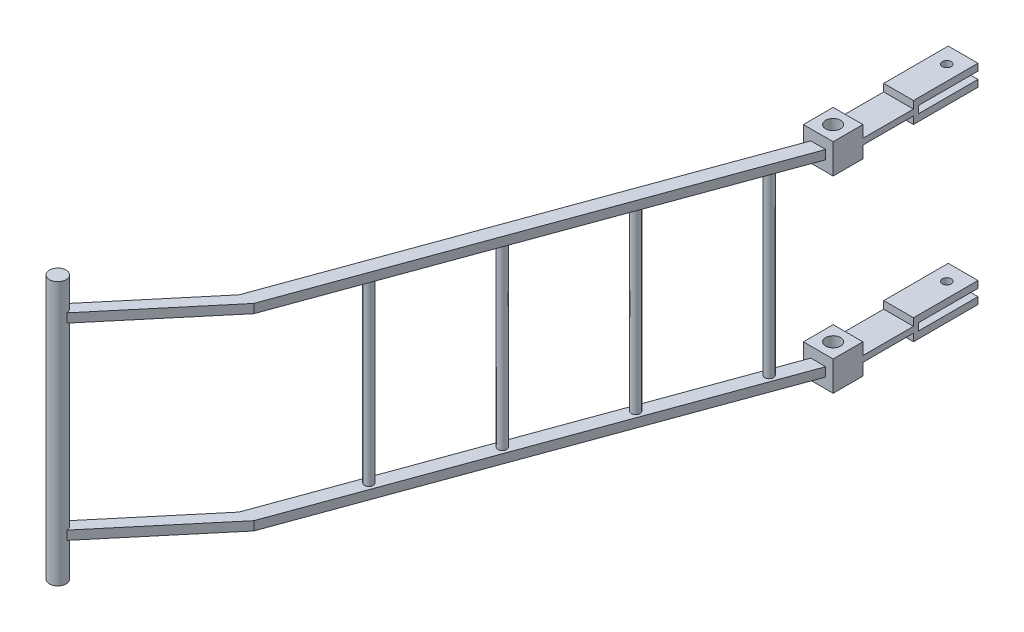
ISO-10303-21;
HEADER;
FILE_DESCRIPTION(('STEP AP214'),'2;1');
FILE_NAME('part.step','',(''),(''),'','','');
FILE_SCHEMA(('AUTOMOTIVE_DESIGN { 1 0 10303 214 1 1 1 1 }'));
ENDSEC;
DATA;
#1=APPLICATION_CONTEXT('core data for automotive mechanical design processes');
#2=APPLICATION_PROTOCOL_DEFINITION('international standard','automotive_design',2000,#1);
#3=PRODUCT_CONTEXT('',#1,'mechanical');
#4=PRODUCT('Part','Part','',(#3));
#5=PRODUCT_RELATED_PRODUCT_CATEGORY('part','',(#4));
#6=PRODUCT_DEFINITION_FORMATION('','',#4);
#7=PRODUCT_DEFINITION_CONTEXT('part definition',#1,'design');
#8=PRODUCT_DEFINITION('design','',#6,#7);
#9=PRODUCT_DEFINITION_SHAPE('','',#8);
#10=(LENGTH_UNIT() NAMED_UNIT(*) SI_UNIT(.MILLI.,.METRE.));
#11=(NAMED_UNIT(*) PLANE_ANGLE_UNIT() SI_UNIT($,.RADIAN.));
#12=(NAMED_UNIT(*) SI_UNIT($,.STERADIAN.) SOLID_ANGLE_UNIT());
#13=UNCERTAINTY_MEASURE_WITH_UNIT(LENGTH_MEASURE(1.E-05),#10,'distance_accuracy_value','');
#14=(GEOMETRIC_REPRESENTATION_CONTEXT(3) GLOBAL_UNCERTAINTY_ASSIGNED_CONTEXT((#13)) GLOBAL_UNIT_ASSIGNED_CONTEXT((#10,
#11,#12)) REPRESENTATION_CONTEXT('',''));
#15=CARTESIAN_POINT('',(0.,0.,0.));
#16=DIRECTION('',(0.,0.,1.));
#17=DIRECTION('',(1.,0.,0.));
#18=AXIS2_PLACEMENT_3D('',#15,#16,#17);
#19=CARTESIAN_POINT('',(-43.8030214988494,6.5,150.953893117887));
#20=DIRECTION('',(0.,-1.,0.));
#21=DIRECTION('',(1.,0.,0.));
#22=AXIS2_PLACEMENT_3D('',#19,#20,#21);
#23=PLANE('',#22);
#24=CARTESIAN_POINT('',(-23.4542294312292,6.5,87.766966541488));
#25=DIRECTION('',(0.,-1.,0.));
#26=DIRECTION('',(1.,0.,0.));
#27=AXIS2_PLACEMENT_3D('',#24,#25,#26);
#28=CIRCLE('',#27,1.45);
#29=CARTESIAN_POINT('',(-22.0042294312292,6.5,87.766966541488));
#30=VERTEX_POINT('',#29);
#31=EDGE_CURVE('E39',#30,#30,#28,.F.);
#32=ORIENTED_EDGE('',*,*,#31,.F.);
#33=EDGE_LOOP('',(#32));
#34=FACE_BOUND('',#33,.T.);
#35=CARTESIAN_POINT('',(0.487180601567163,6.5,21.9884830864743));
#36=DIRECTION('',(0.,-1.,0.));
#37=DIRECTION('',(1.,0.,0.));
#38=AXIS2_PLACEMENT_3D('',#35,#36,#37);
#39=CIRCLE('',#38,1.45);
#40=CARTESIAN_POINT('',(1.93718060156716,6.5,21.9884830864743));
#41=VERTEX_POINT('',#40);
#42=EDGE_CURVE('E34',#41,#41,#39,.F.);
#43=ORIENTED_EDGE('',*,*,#42,.F.);
#44=EDGE_LOOP('',(#43));
#45=FACE_BOUND('',#44,.T.);
#46=DIRECTION('',(0.342020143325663,0.,-0.939692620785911));
#47=VECTOR('',#46,1.);
#48=CARTESIAN_POINT('',(-48.8030214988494,6.5,150.953893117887));
#49=LINE('',#48,#47);
#50=CARTESIAN_POINT('',(-48.8030214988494,6.5,150.953893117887));
#51=VERTEX_POINT('',#50);
#52=CARTESIAN_POINT('',(2.5,6.5,10.));
#53=VERTEX_POINT('',#52);
#54=EDGE_CURVE('E706',#51,#53,#49,.T.);
#55=ORIENTED_EDGE('',*,*,#54,.F.);
#56=DIRECTION('',(0.64278760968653,0.,-0.766044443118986));
#57=VECTOR('',#56,1.);
#58=CARTESIAN_POINT('',(-77.7284639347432,6.5,185.425893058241));
#59=LINE('',#58,#57);
#60=CARTESIAN_POINT('',(-75.382544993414,6.5,182.630135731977));
#61=VERTEX_POINT('',#60);
#62=EDGE_CURVE('E735',#61,#51,#59,.T.);
#63=ORIENTED_EDGE('',*,*,#62,.F.);
#64=CARTESIAN_POINT('',(-75.2284639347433,6.5,185.425893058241));
#65=DIRECTION('',(0.,-1.,0.));
#66=DIRECTION('',(1.,0.,0.));
#67=AXIS2_PLACEMENT_3D('',#64,#65,#66);
#68=CIRCLE('',#67,2.8);
#69=CARTESIAN_POINT('',(-72.4484245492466,6.5,185.092155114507));
#70=VERTEX_POINT('',#69);
#71=EDGE_CURVE('E744',#61,#70,#68,.T.);
#72=ORIENTED_EDGE('',*,*,#71,.T.);
#73=DIRECTION('',(0.64278760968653,0.,-0.766044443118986));
#74=VECTOR('',#73,1.);
#75=CARTESIAN_POINT('',(-72.7284639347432,6.5,185.425893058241));
#76=LINE('',#75,#74);
#77=CARTESIAN_POINT('',(-43.8030214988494,6.5,150.953893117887));
#78=VERTEX_POINT('',#77);
#79=EDGE_CURVE('E729',#70,#78,#76,.T.);
#80=ORIENTED_EDGE('',*,*,#79,.T.);
#81=DIRECTION('',(0.342020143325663,0.,-0.939692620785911));
#82=VECTOR('',#81,1.);
#83=CARTESIAN_POINT('',(-43.8030214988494,6.5,150.953893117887));
#84=LINE('',#83,#82);
#85=CARTESIAN_POINT('',(7.5,6.5,10.));
#86=VERTEX_POINT('',#85);
#87=EDGE_CURVE('E703',#78,#86,#84,.T.);
#88=ORIENTED_EDGE('',*,*,#87,.T.);
#89=DIRECTION('',(-1.,0.,0.));
#90=VECTOR('',#89,1.);
#91=CARTESIAN_POINT('',(7.5,6.5,10.));
#92=LINE('',#91,#90);
#93=EDGE_CURVE('E723',#86,#53,#92,.T.);
#94=ORIENTED_EDGE('',*,*,#93,.T.);
#95=EDGE_LOOP('',(#55,#63,#72,#80,#88,#94));
#96=FACE_BOUND('',#95,.T.);
#97=CARTESIAN_POINT('',(-11.483524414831,6.5,54.8777248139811));
#98=DIRECTION('',(0.,-1.,0.));
#99=DIRECTION('',(1.,0.,0.));
#100=AXIS2_PLACEMENT_3D('',#97,#98,#99);
#101=CIRCLE('',#100,1.45);
#102=CARTESIAN_POINT('',(-10.033524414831,6.5,54.8777248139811));
#103=VERTEX_POINT('',#102);
#104=EDGE_CURVE('E984',#103,#103,#101,.F.);
#105=ORIENTED_EDGE('',*,*,#104,.F.);
#106=EDGE_LOOP('',(#105));
#107=FACE_BOUND('',#106,.T.);
#108=CARTESIAN_POINT('',(-35.4249344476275,6.5,120.656208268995));
#109=DIRECTION('',(0.,-1.,0.));
#110=DIRECTION('',(1.,0.,0.));
#111=AXIS2_PLACEMENT_3D('',#108,#109,#110);
#112=CIRCLE('',#111,1.45);
#113=CARTESIAN_POINT('',(-33.9749344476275,6.5,120.656208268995));
#114=VERTEX_POINT('',#113);
#115=EDGE_CURVE('E11',#114,#114,#112,.F.);
#116=ORIENTED_EDGE('',*,*,#115,.F.);
#117=EDGE_LOOP('',(#116));
#118=FACE_BOUND('',#117,.T.);
#119=ADVANCED_FACE('F30',(#34,#45,#96,#107,#118),#23,.F.);
#120=CARTESIAN_POINT('',(-72.7284639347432,66.75,185.425893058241));
#121=DIRECTION('',(0.,-1.,0.));
#122=DIRECTION('',(0.,0.,-1.));
#123=AXIS2_PLACEMENT_3D('',#120,#121,#122);
#124=PLANE('',#123);
#125=CARTESIAN_POINT('',(-23.4542294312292,66.75,87.766966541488));
#126=DIRECTION('',(0.,-1.,0.));
#127=DIRECTION('',(0.,0.,-1.));
#128=AXIS2_PLACEMENT_3D('',#125,#126,#127);
#129=CIRCLE('',#128,1.45);
#130=CARTESIAN_POINT('',(-23.4542294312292,66.75,86.316966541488));
#131=VERTEX_POINT('',#130);
#132=EDGE_CURVE('E397',#131,#131,#129,.T.);
#133=ORIENTED_EDGE('',*,*,#132,.F.);
#134=EDGE_LOOP('',(#133));
#135=FACE_BOUND('',#134,.T.);
#136=DIRECTION('',(0.342020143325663,0.,-0.939692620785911));
#137=VECTOR('',#136,1.);
#138=CARTESIAN_POINT('',(-43.8030214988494,66.75,150.953893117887));
#139=LINE('',#138,#137);
#140=CARTESIAN_POINT('',(-43.8030214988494,66.75,150.953893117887));
#141=VERTEX_POINT('',#140);
#142=CARTESIAN_POINT('',(7.5,66.75,10.));
#143=VERTEX_POINT('',#142);
#144=EDGE_CURVE('E778',#141,#143,#139,.T.);
#145=ORIENTED_EDGE('',*,*,#144,.F.);
#146=DIRECTION('',(0.64278760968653,0.,-0.766044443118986));
#147=VECTOR('',#146,1.);
#148=CARTESIAN_POINT('',(-72.7284639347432,66.75,185.425893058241));
#149=LINE('',#148,#147);
#150=CARTESIAN_POINT('',(-72.4484245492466,66.75,185.092155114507));
#151=VERTEX_POINT('',#150);
#152=EDGE_CURVE('E763',#151,#141,#149,.T.);
#153=ORIENTED_EDGE('',*,*,#152,.F.);
#154=CARTESIAN_POINT('',(-75.2284639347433,66.75,185.425893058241));
#155=DIRECTION('',(0.,-1.,0.));
#156=DIRECTION('',(0.,0.,-1.));
#157=AXIS2_PLACEMENT_3D('',#154,#155,#156);
#158=CIRCLE('',#157,2.8);
#159=CARTESIAN_POINT('',(-75.382544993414,66.75,182.630135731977));
#160=VERTEX_POINT('',#159);
#161=EDGE_CURVE('E1005',#151,#160,#158,.F.);
#162=ORIENTED_EDGE('',*,*,#161,.T.);
#163=DIRECTION('',(0.64278760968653,0.,-0.766044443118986));
#164=VECTOR('',#163,1.);
#165=CARTESIAN_POINT('',(-77.7284639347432,66.75,185.425893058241));
#166=LINE('',#165,#164);
#167=CARTESIAN_POINT('',(-48.8030214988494,66.75,150.953893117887));
#168=VERTEX_POINT('',#167);
#169=EDGE_CURVE('E761',#160,#168,#166,.T.);
#170=ORIENTED_EDGE('',*,*,#169,.T.);
#171=DIRECTION('',(0.342020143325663,0.,-0.939692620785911));
#172=VECTOR('',#171,1.);
#173=CARTESIAN_POINT('',(-48.8030214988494,66.75,150.953893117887));
#174=LINE('',#173,#172);
#175=CARTESIAN_POINT('',(2.5,66.75,10.));
#176=VERTEX_POINT('',#175);
#177=EDGE_CURVE('E776',#168,#176,#174,.T.);
#178=ORIENTED_EDGE('',*,*,#177,.T.);
#179=DIRECTION('',(-1.,0.,0.));
#180=VECTOR('',#179,1.);
#181=CARTESIAN_POINT('',(7.5,66.75,10.));
#182=LINE('',#181,#180);
#183=EDGE_CURVE('E780',#143,#176,#182,.T.);
#184=ORIENTED_EDGE('',*,*,#183,.F.);
#185=EDGE_LOOP('',(#145,#153,#162,#170,#178,#184));
#186=FACE_BOUND('',#185,.T.);
#187=CARTESIAN_POINT('',(0.487180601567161,66.75,21.9884830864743));
#188=DIRECTION('',(0.,-1.,0.));
#189=DIRECTION('',(0.,0.,-1.));
#190=AXIS2_PLACEMENT_3D('',#187,#188,#189);
#191=CIRCLE('',#190,1.45);
#192=CARTESIAN_POINT('',(0.487180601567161,66.75,20.5384830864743));
#193=VERTEX_POINT('',#192);
#194=EDGE_CURVE('E400',#193,#193,#191,.T.);
#195=ORIENTED_EDGE('',*,*,#194,.F.);
#196=EDGE_LOOP('',(#195));
#197=FACE_BOUND('',#196,.T.);
#198=CARTESIAN_POINT('',(-11.483524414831,66.75,54.8777248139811));
#199=DIRECTION('',(0.,-1.,0.));
#200=DIRECTION('',(0.,0.,-1.));
#201=AXIS2_PLACEMENT_3D('',#198,#199,#200);
#202=CIRCLE('',#201,1.45);
#203=CARTESIAN_POINT('',(-11.483524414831,66.75,53.4277248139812));
#204=VERTEX_POINT('',#203);
#205=EDGE_CURVE('E393',#204,#204,#202,.T.);
#206=ORIENTED_EDGE('',*,*,#205,.F.);
#207=EDGE_LOOP('',(#206));
#208=FACE_BOUND('',#207,.T.);
#209=CARTESIAN_POINT('',(-35.4249344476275,66.75,120.656208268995));
#210=DIRECTION('',(0.,-1.,0.));
#211=DIRECTION('',(0.,0.,-1.));
#212=AXIS2_PLACEMENT_3D('',#209,#210,#211);
#213=CIRCLE('',#212,1.45);
#214=CARTESIAN_POINT('',(-35.4249344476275,66.75,119.206208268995));
#215=VERTEX_POINT('',#214);
#216=EDGE_CURVE('E975',#215,#215,#213,.T.);
#217=ORIENTED_EDGE('',*,*,#216,.F.);
#218=EDGE_LOOP('',(#217));
#219=FACE_BOUND('',#218,.T.);
#220=ADVANCED_FACE('F432',(#135,#186,#197,#208,#219),#124,.T.);
#221=CARTESIAN_POINT('',(10.,64.75,-18.7));
#222=DIRECTION('',(0.,-1.,0.));
#223=DIRECTION('',(0.,0.,-1.));
#224=AXIS2_PLACEMENT_3D('',#221,#222,#223);
#225=PLANE('',#224);
#226=DIRECTION('',(1.,0.,0.));
#227=VECTOR('',#226,1.);
#228=CARTESIAN_POINT('',(10.,64.75,-17.));
#229=LINE('',#228,#227);
#230=CARTESIAN_POINT('',(0.,64.75,-17.));
#231=VERTEX_POINT('',#230);
#232=CARTESIAN_POINT('',(10.,64.75,-17.));
#233=VERTEX_POINT('',#232);
#234=EDGE_CURVE('E870',#231,#233,#229,.T.);
#235=ORIENTED_EDGE('',*,*,#234,.F.);
#236=DIRECTION('',(0.,0.,1.));
#237=VECTOR('',#236,1.);
#238=CARTESIAN_POINT('',(0.,64.75,-18.7));
#239=LINE('',#238,#237);
#240=CARTESIAN_POINT('',(0.,64.75,-38.7));
#241=VERTEX_POINT('',#240);
#242=EDGE_CURVE('E326',#241,#231,#239,.T.);
#243=ORIENTED_EDGE('',*,*,#242,.F.);
#244=DIRECTION('',(1.,0.,0.));
#245=VECTOR('',#244,1.);
#246=CARTESIAN_POINT('',(10.,64.75,-38.7));
#247=LINE('',#246,#245);
#248=CARTESIAN_POINT('',(10.,64.75,-38.7));
#249=VERTEX_POINT('',#248);
#250=EDGE_CURVE('E332',#241,#249,#247,.T.);
#251=ORIENTED_EDGE('',*,*,#250,.T.);
#252=DIRECTION('',(0.,0.,1.));
#253=VECTOR('',#252,1.);
#254=CARTESIAN_POINT('',(10.,64.75,-18.7));
#255=LINE('',#254,#253);
#256=EDGE_CURVE('E313',#249,#233,#255,.T.);
#257=ORIENTED_EDGE('',*,*,#256,.T.);
#258=EDGE_LOOP('',(#235,#243,#251,#257));
#259=FACE_BOUND('',#258,.T.);
#260=CARTESIAN_POINT('',(5.,64.75,-33.2));
#261=DIRECTION('',(0.,1.,0.));
#262=DIRECTION('',(0.,0.,1.));
#263=AXIS2_PLACEMENT_3D('',#260,#261,#262);
#264=CIRCLE('',#263,1.5);
#265=CARTESIAN_POINT('',(5.,64.75,-31.7));
#266=VERTEX_POINT('',#265);
#267=EDGE_CURVE('E387',#266,#266,#264,.T.);
#268=ORIENTED_EDGE('',*,*,#267,.T.);
#269=EDGE_LOOP('',(#268));
#270=FACE_BOUND('',#269,.T.);
#271=ADVANCED_FACE('F337',(#259,#270),#225,.T.);
#272=CARTESIAN_POINT('',(10.,71.75,-18.7));
#273=DIRECTION('',(0.,1.,0.));
#274=DIRECTION('',(0.,0.,1.));
#275=AXIS2_PLACEMENT_3D('',#272,#273,#274);
#276=PLANE('',#275);
#277=DIRECTION('',(-1.,0.,0.));
#278=VECTOR('',#277,1.);
#279=CARTESIAN_POINT('',(10.,71.75,-17.));
#280=LINE('',#279,#278);
#281=CARTESIAN_POINT('',(10.,71.75,-17.));
#282=VERTEX_POINT('',#281);
#283=CARTESIAN_POINT('',(0.,71.75,-17.));
#284=VERTEX_POINT('',#283);
#285=EDGE_CURVE('E383',#282,#284,#280,.T.);
#286=ORIENTED_EDGE('',*,*,#285,.F.);
#287=DIRECTION('',(0.,0.,1.));
#288=VECTOR('',#287,1.);
#289=CARTESIAN_POINT('',(10.,71.75,-18.7));
#290=LINE('',#289,#288);
#291=CARTESIAN_POINT('',(10.,71.75,-38.7));
#292=VERTEX_POINT('',#291);
#293=EDGE_CURVE('E879',#292,#282,#290,.T.);
#294=ORIENTED_EDGE('',*,*,#293,.F.);
#295=DIRECTION('',(-1.,0.,0.));
#296=VECTOR('',#295,1.);
#297=CARTESIAN_POINT('',(10.,71.75,-38.7));
#298=LINE('',#297,#296);
#299=CARTESIAN_POINT('',(0.,71.75,-38.7));
#300=VERTEX_POINT('',#299);
#301=EDGE_CURVE('E361',#292,#300,#298,.T.);
#302=ORIENTED_EDGE('',*,*,#301,.T.);
#303=DIRECTION('',(0.,0.,1.));
#304=VECTOR('',#303,1.);
#305=CARTESIAN_POINT('',(0.,71.75,-18.7));
#306=LINE('',#305,#304);
#307=EDGE_CURVE('E882',#300,#284,#306,.T.);
#308=ORIENTED_EDGE('',*,*,#307,.T.);
#309=EDGE_LOOP('',(#286,#294,#302,#308));
#310=FACE_BOUND('',#309,.T.);
#311=CARTESIAN_POINT('',(5.,71.75,-33.2));
#312=DIRECTION('',(0.,1.,0.));
#313=DIRECTION('',(0.,0.,1.));
#314=AXIS2_PLACEMENT_3D('',#311,#312,#313);
#315=CIRCLE('',#314,1.5);
#316=CARTESIAN_POINT('',(5.,71.75,-31.7));
#317=VERTEX_POINT('',#316);
#318=EDGE_CURVE('E348',#317,#317,#315,.F.);
#319=ORIENTED_EDGE('',*,*,#318,.T.);
#320=EDGE_LOOP('',(#319));
#321=FACE_BOUND('',#320,.T.);
#322=ADVANCED_FACE('F405',(#310,#321),#276,.T.);
#323=CARTESIAN_POINT('',(10.,69.45,-38.7));
#324=DIRECTION('',(0.,-1.,0.));
#325=DIRECTION('',(0.,0.,-1.));
#326=AXIS2_PLACEMENT_3D('',#323,#324,#325);
#327=PLANE('',#326);
#328=DIRECTION('',(1.,0.,0.));
#329=VECTOR('',#328,1.);
#330=CARTESIAN_POINT('',(10.,69.45,-18.7));
#331=LINE('',#330,#329);
#332=CARTESIAN_POINT('',(0.,69.45,-18.7));
#333=VERTEX_POINT('',#332);
#334=CARTESIAN_POINT('',(10.,69.45,-18.7));
#335=VERTEX_POINT('',#334);
#336=EDGE_CURVE('E351',#333,#335,#331,.T.);
#337=ORIENTED_EDGE('',*,*,#336,.F.);
#338=DIRECTION('',(0.,0.,1.));
#339=VECTOR('',#338,1.);
#340=CARTESIAN_POINT('',(0.,69.45,-38.7));
#341=LINE('',#340,#339);
#342=CARTESIAN_POINT('',(0.,69.45,-38.7));
#343=VERTEX_POINT('',#342);
#344=EDGE_CURVE('E364',#343,#333,#341,.T.);
#345=ORIENTED_EDGE('',*,*,#344,.F.);
#346=DIRECTION('',(1.,0.,0.));
#347=VECTOR('',#346,1.);
#348=CARTESIAN_POINT('',(10.,69.45,-38.7));
#349=LINE('',#348,#347);
#350=CARTESIAN_POINT('',(10.,69.45,-38.7));
#351=VERTEX_POINT('',#350);
#352=EDGE_CURVE('E355',#343,#351,#349,.T.);
#353=ORIENTED_EDGE('',*,*,#352,.T.);
#354=DIRECTION('',(0.,0.,1.));
#355=VECTOR('',#354,1.);
#356=CARTESIAN_POINT('',(10.,69.45,-38.7));
#357=LINE('',#356,#355);
#358=EDGE_CURVE('E375',#351,#335,#357,.T.);
#359=ORIENTED_EDGE('',*,*,#358,.T.);
#360=EDGE_LOOP('',(#337,#345,#353,#359));
#361=FACE_BOUND('',#360,.T.);
#362=CARTESIAN_POINT('',(5.,69.45,-33.2));
#363=DIRECTION('',(0.,-1.,0.));
#364=DIRECTION('',(0.,0.,-1.));
#365=AXIS2_PLACEMENT_3D('',#362,#363,#364);
#366=CIRCLE('',#365,1.5);
#367=CARTESIAN_POINT('',(5.,69.45,-34.7));
#368=VERTEX_POINT('',#367);
#369=EDGE_CURVE('E386',#368,#368,#366,.F.);
#370=ORIENTED_EDGE('',*,*,#369,.T.);
#371=EDGE_LOOP('',(#370));
#372=FACE_BOUND('',#371,.T.);
#373=ADVANCED_FACE('F415',(#361,#372),#327,.T.);
#374=CARTESIAN_POINT('',(10.,67.05,-38.7));
#375=DIRECTION('',(0.,1.,0.));
#376=DIRECTION('',(0.,0.,1.));
#377=AXIS2_PLACEMENT_3D('',#374,#375,#376);
#378=PLANE('',#377);
#379=DIRECTION('',(-1.,0.,0.));
#380=VECTOR('',#379,1.);
#381=CARTESIAN_POINT('',(10.,67.05,-18.7));
#382=LINE('',#381,#380);
#383=CARTESIAN_POINT('',(10.,67.05,-18.7));
#384=VERTEX_POINT('',#383);
#385=CARTESIAN_POINT('',(0.,67.05,-18.7));
#386=VERTEX_POINT('',#385);
#387=EDGE_CURVE('E335',#384,#386,#382,.T.);
#388=ORIENTED_EDGE('',*,*,#387,.F.);
#389=DIRECTION('',(0.,0.,1.));
#390=VECTOR('',#389,1.);
#391=CARTESIAN_POINT('',(10.,67.05,-38.7));
#392=LINE('',#391,#390);
#393=CARTESIAN_POINT('',(10.,67.05,-38.7));
#394=VERTEX_POINT('',#393);
#395=EDGE_CURVE('E346',#394,#384,#392,.T.);
#396=ORIENTED_EDGE('',*,*,#395,.F.);
#397=DIRECTION('',(-1.,0.,0.));
#398=VECTOR('',#397,1.);
#399=CARTESIAN_POINT('',(10.,67.05,-38.7));
#400=LINE('',#399,#398);
#401=CARTESIAN_POINT('',(0.,67.05,-38.7));
#402=VERTEX_POINT('',#401);
#403=EDGE_CURVE('E334',#394,#402,#400,.T.);
#404=ORIENTED_EDGE('',*,*,#403,.T.);
#405=DIRECTION('',(0.,0.,1.));
#406=VECTOR('',#405,1.);
#407=CARTESIAN_POINT('',(0.,67.05,-38.7));
#408=LINE('',#407,#406);
#409=EDGE_CURVE('E47',#402,#386,#408,.T.);
#410=ORIENTED_EDGE('',*,*,#409,.T.);
#411=EDGE_LOOP('',(#388,#396,#404,#410));
#412=FACE_BOUND('',#411,.T.);
#413=CARTESIAN_POINT('',(5.,67.05,-33.2));
#414=DIRECTION('',(0.,1.,0.));
#415=DIRECTION('',(0.,0.,1.));
#416=AXIS2_PLACEMENT_3D('',#413,#414,#415);
#417=CIRCLE('',#416,1.5);
#418=CARTESIAN_POINT('',(5.,67.05,-31.7));
#419=VERTEX_POINT('',#418);
#420=EDGE_CURVE('E384',#419,#419,#417,.F.);
#421=ORIENTED_EDGE('',*,*,#420,.T.);
#422=EDGE_LOOP('',(#421));
#423=FACE_BOUND('',#422,.T.);
#424=ADVANCED_FACE('F417',(#412,#423),#378,.T.);
#425=CARTESIAN_POINT('',(0.,63.25,0.));
#426=DIRECTION('',(0.,0.,-1.));
#427=DIRECTION('',(-1.,0.,0.));
#428=AXIS2_PLACEMENT_3D('',#425,#426,#427);
#429=PLANE('',#428);
#430=DIRECTION('',(0.,-1.,0.));
#431=VECTOR('',#430,1.);
#432=CARTESIAN_POINT('',(10.,73.25,0.));
#433=LINE('',#432,#431);
#434=CARTESIAN_POINT('',(10.,73.25,0.));
#435=VERTEX_POINT('',#434);
#436=CARTESIAN_POINT('',(10.,69.25,0.));
#437=VERTEX_POINT('',#436);
#438=EDGE_CURVE('E807',#435,#437,#433,.T.);
#439=ORIENTED_EDGE('',*,*,#438,.T.);
#440=DIRECTION('',(-1.,0.,0.));
#441=VECTOR('',#440,1.);
#442=CARTESIAN_POINT('',(10.,69.25,0.));
#443=LINE('',#442,#441);
#444=CARTESIAN_POINT('',(0.,69.25,0.));
#445=VERTEX_POINT('',#444);
#446=EDGE_CURVE('E848',#437,#445,#443,.T.);
#447=ORIENTED_EDGE('',*,*,#446,.T.);
#448=DIRECTION('',(0.,1.,0.));
#449=VECTOR('',#448,1.);
#450=CARTESIAN_POINT('',(0.,73.25,0.));
#451=LINE('',#450,#449);
#452=CARTESIAN_POINT('',(0.,73.25,0.));
#453=VERTEX_POINT('',#452);
#454=EDGE_CURVE('E819',#445,#453,#451,.T.);
#455=ORIENTED_EDGE('',*,*,#454,.T.);
#456=DIRECTION('',(1.,0.,0.));
#457=VECTOR('',#456,1.);
#458=CARTESIAN_POINT('',(0.,73.25,0.));
#459=LINE('',#458,#457);
#460=EDGE_CURVE('E803',#453,#435,#459,.T.);
#461=ORIENTED_EDGE('',*,*,#460,.T.);
#462=EDGE_LOOP('',(#439,#447,#455,#461));
#463=FACE_BOUND('',#462,.T.);
#464=ADVANCED_FACE('F424',(#463),#429,.T.);
#465=CARTESIAN_POINT('',(0.,63.25,0.));
#466=VERTEX_POINT('',#465);
#467=CARTESIAN_POINT('',(0.,67.25,0.));
#468=VERTEX_POINT('',#467);
#469=EDGE_CURVE('E821',#466,#468,#451,.T.);
#470=ORIENTED_EDGE('',*,*,#469,.T.);
#471=DIRECTION('',(1.,0.,0.));
#472=VECTOR('',#471,1.);
#473=CARTESIAN_POINT('',(10.,67.25,0.));
#474=LINE('',#473,#472);
#475=CARTESIAN_POINT('',(10.,67.25,0.));
#476=VERTEX_POINT('',#475);
#477=EDGE_CURVE('E325',#468,#476,#474,.T.);
#478=ORIENTED_EDGE('',*,*,#477,.T.);
#479=CARTESIAN_POINT('',(10.,63.25,0.));
#480=VERTEX_POINT('',#479);
#481=EDGE_CURVE('E814',#476,#480,#433,.T.);
#482=ORIENTED_EDGE('',*,*,#481,.T.);
#483=DIRECTION('',(-1.,0.,0.));
#484=VECTOR('',#483,1.);
#485=CARTESIAN_POINT('',(0.,63.25,0.));
#486=LINE('',#485,#484);
#487=EDGE_CURVE('E810',#480,#466,#486,.T.);
#488=ORIENTED_EDGE('',*,*,#487,.T.);
#489=EDGE_LOOP('',(#470,#478,#482,#488));
#490=FACE_BOUND('',#489,.T.);
#491=ADVANCED_FACE('F925',(#490),#429,.T.);
#492=CARTESIAN_POINT('',(0.,63.25,10.));
#493=DIRECTION('',(0.,-1.,0.));
#494=DIRECTION('',(0.,0.,-1.));
#495=AXIS2_PLACEMENT_3D('',#492,#493,#494);
#496=PLANE('',#495);
#497=ORIENTED_EDGE('',*,*,#487,.F.);
#498=DIRECTION('',(0.,0.,-1.));
#499=VECTOR('',#498,1.);
#500=CARTESIAN_POINT('',(10.,63.25,10.));
#501=LINE('',#500,#499);
#502=CARTESIAN_POINT('',(10.,63.25,10.));
#503=VERTEX_POINT('',#502);
#504=EDGE_CURVE('E794',#503,#480,#501,.T.);
#505=ORIENTED_EDGE('',*,*,#504,.F.);
#506=DIRECTION('',(-1.,0.,0.));
#507=VECTOR('',#506,1.);
#508=CARTESIAN_POINT('',(0.,63.25,10.));
#509=LINE('',#508,#507);
#510=CARTESIAN_POINT('',(0.,63.25,10.));
#511=VERTEX_POINT('',#510);
#512=EDGE_CURVE('E832',#503,#511,#509,.T.);
#513=ORIENTED_EDGE('',*,*,#512,.T.);
#514=DIRECTION('',(0.,0.,-1.));
#515=VECTOR('',#514,1.);
#516=CARTESIAN_POINT('',(0.,63.25,10.));
#517=LINE('',#516,#515);
#518=EDGE_CURVE('E792',#511,#466,#517,.T.);
#519=ORIENTED_EDGE('',*,*,#518,.T.);
#520=EDGE_LOOP('',(#497,#505,#513,#519));
#521=FACE_BOUND('',#520,.T.);
#522=CARTESIAN_POINT('',(5.,63.25,5.));
#523=DIRECTION('',(0.,1.,0.));
#524=DIRECTION('',(0.,0.,1.));
#525=AXIS2_PLACEMENT_3D('',#522,#523,#524);
#526=CIRCLE('',#525,2.5);
#527=CARTESIAN_POINT('',(5.,63.25,7.5));
#528=VERTEX_POINT('',#527);
#529=EDGE_CURVE('E837',#528,#528,#526,.T.);
#530=ORIENTED_EDGE('',*,*,#529,.T.);
#531=EDGE_LOOP('',(#530));
#532=FACE_BOUND('',#531,.T.);
#533=ADVANCED_FACE('F920',(#521,#532),#496,.T.);
#534=CARTESIAN_POINT('',(0.,73.25,10.));
#535=DIRECTION('',(0.,1.,0.));
#536=DIRECTION('',(0.,0.,1.));
#537=AXIS2_PLACEMENT_3D('',#534,#535,#536);
#538=PLANE('',#537);
#539=ORIENTED_EDGE('',*,*,#460,.F.);
#540=DIRECTION('',(0.,0.,-1.));
#541=VECTOR('',#540,1.);
#542=CARTESIAN_POINT('',(0.,73.25,10.));
#543=LINE('',#542,#541);
#544=CARTESIAN_POINT('',(0.,73.25,10.));
#545=VERTEX_POINT('',#544);
#546=EDGE_CURVE('E799',#545,#453,#543,.T.);
#547=ORIENTED_EDGE('',*,*,#546,.F.);
#548=DIRECTION('',(1.,0.,0.));
#549=VECTOR('',#548,1.);
#550=CARTESIAN_POINT('',(0.,73.25,10.));
#551=LINE('',#550,#549);
#552=CARTESIAN_POINT('',(10.,73.25,10.));
#553=VERTEX_POINT('',#552);
#554=EDGE_CURVE('E802',#545,#553,#551,.T.);
#555=ORIENTED_EDGE('',*,*,#554,.T.);
#556=DIRECTION('',(0.,0.,-1.));
#557=VECTOR('',#556,1.);
#558=CARTESIAN_POINT('',(10.,73.25,10.));
#559=LINE('',#558,#557);
#560=EDGE_CURVE('E797',#553,#435,#559,.T.);
#561=ORIENTED_EDGE('',*,*,#560,.T.);
#562=EDGE_LOOP('',(#539,#547,#555,#561));
#563=FACE_BOUND('',#562,.T.);
#564=CARTESIAN_POINT('',(5.,73.25,5.));
#565=DIRECTION('',(0.,1.,0.));
#566=DIRECTION('',(0.,0.,1.));
#567=AXIS2_PLACEMENT_3D('',#564,#565,#566);
#568=CIRCLE('',#567,2.5);
#569=CARTESIAN_POINT('',(5.,73.25,7.5));
#570=VERTEX_POINT('',#569);
#571=EDGE_CURVE('E822',#570,#570,#568,.T.);
#572=ORIENTED_EDGE('',*,*,#571,.F.);
#573=EDGE_LOOP('',(#572));
#574=FACE_BOUND('',#573,.T.);
#575=ADVANCED_FACE('F505',(#563,#574),#538,.T.);
#576=CARTESIAN_POINT('',(0.,10.,10.));
#577=DIRECTION('',(0.,0.,-1.));
#578=DIRECTION('',(-1.,0.,0.));
#579=AXIS2_PLACEMENT_3D('',#576,#577,#578);
#580=PLANE('',#579);
#581=DIRECTION('',(0.,-1.,0.));
#582=VECTOR('',#581,1.);
#583=CARTESIAN_POINT('',(0.,0.,10.));
#584=LINE('',#583,#582);
#585=CARTESIAN_POINT('',(0.,10.,10.));
#586=VERTEX_POINT('',#585);
#587=CARTESIAN_POINT('',(0.,0.,10.));
#588=VERTEX_POINT('',#587);
#589=EDGE_CURVE('E553',#586,#588,#584,.T.);
#590=ORIENTED_EDGE('',*,*,#589,.T.);
#591=DIRECTION('',(1.,0.,0.));
#592=VECTOR('',#591,1.);
#593=CARTESIAN_POINT('',(0.,0.,10.));
#594=LINE('',#593,#592);
#595=CARTESIAN_POINT('',(10.,0.,10.));
#596=VERTEX_POINT('',#595);
#597=EDGE_CURVE('E578',#588,#596,#594,.T.);
#598=ORIENTED_EDGE('',*,*,#597,.T.);
#599=DIRECTION('',(0.,1.,0.));
#600=VECTOR('',#599,1.);
#601=CARTESIAN_POINT('',(10.,0.,10.));
#602=LINE('',#601,#600);
#603=CARTESIAN_POINT('',(10.,10.,10.));
#604=VERTEX_POINT('',#603);
#605=EDGE_CURVE('E546',#596,#604,#602,.T.);
#606=ORIENTED_EDGE('',*,*,#605,.T.);
#607=DIRECTION('',(-1.,0.,0.));
#608=VECTOR('',#607,1.);
#609=CARTESIAN_POINT('',(0.,10.,10.));
#610=LINE('',#609,#608);
#611=EDGE_CURVE('E568',#604,#586,#610,.T.);
#612=ORIENTED_EDGE('',*,*,#611,.T.);
#613=EDGE_LOOP('',(#590,#598,#606,#612));
#614=FACE_BOUND('',#613,.T.);
#615=DIRECTION('',(0.,1.,0.));
#616=VECTOR('',#615,1.);
#617=CARTESIAN_POINT('',(7.5,6.5,10.));
#618=LINE('',#617,#616);
#619=CARTESIAN_POINT('',(7.5,3.5,10.));
#620=VERTEX_POINT('',#619);
#621=EDGE_CURVE('E726',#620,#86,#618,.T.);
#622=ORIENTED_EDGE('',*,*,#621,.F.);
#623=DIRECTION('',(1.,0.,0.));
#624=VECTOR('',#623,1.);
#625=CARTESIAN_POINT('',(7.5,3.5,10.));
#626=LINE('',#625,#624);
#627=CARTESIAN_POINT('',(2.5,3.5,10.));
#628=VERTEX_POINT('',#627);
#629=EDGE_CURVE('E716',#628,#620,#626,.T.);
#630=ORIENTED_EDGE('',*,*,#629,.F.);
#631=DIRECTION('',(0.,-1.,0.));
#632=VECTOR('',#631,1.);
#633=CARTESIAN_POINT('',(2.5,6.5,10.));
#634=LINE('',#633,#632);
#635=EDGE_CURVE('E720',#53,#628,#634,.T.);
#636=ORIENTED_EDGE('',*,*,#635,.F.);
#637=ORIENTED_EDGE('',*,*,#93,.F.);
#638=EDGE_LOOP('',(#622,#630,#636,#637));
#639=FACE_BOUND('',#638,.T.);
#640=ADVANCED_FACE('F476',(#614,#639),#580,.F.);
#641=CARTESIAN_POINT('',(10.,8.5,-18.7));
#642=DIRECTION('',(0.,0.,1.));
#643=DIRECTION('',(1.,0.,0.));
#644=AXIS2_PLACEMENT_3D('',#641,#642,#643);
#645=PLANE('',#644);
#646=DIRECTION('',(-1.,0.,0.));
#647=VECTOR('',#646,1.);
#648=CARTESIAN_POINT('',(10.,6.2,-18.7));
#649=LINE('',#648,#647);
#650=CARTESIAN_POINT('',(10.,6.2,-18.7));
#651=VERTEX_POINT('',#650);
#652=CARTESIAN_POINT('',(0.,6.2,-18.7));
#653=VERTEX_POINT('',#652);
#654=EDGE_CURVE('E680',#651,#653,#649,.T.);
#655=ORIENTED_EDGE('',*,*,#654,.F.);
#656=DIRECTION('',(0.,-1.,0.));
#657=VECTOR('',#656,1.);
#658=CARTESIAN_POINT('',(10.,1.5,-18.7));
#659=LINE('',#658,#657);
#660=CARTESIAN_POINT('',(10.,3.8,-18.7));
#661=VERTEX_POINT('',#660);
#662=EDGE_CURVE('E631',#651,#661,#659,.T.);
#663=ORIENTED_EDGE('',*,*,#662,.T.);
#664=DIRECTION('',(1.,0.,0.));
#665=VECTOR('',#664,1.);
#666=CARTESIAN_POINT('',(10.,3.8,-18.7));
#667=LINE('',#666,#665);
#668=CARTESIAN_POINT('',(0.,3.8,-18.7));
#669=VERTEX_POINT('',#668);
#670=EDGE_CURVE('E656',#669,#661,#667,.T.);
#671=ORIENTED_EDGE('',*,*,#670,.F.);
#672=DIRECTION('',(0.,1.,0.));
#673=VECTOR('',#672,1.);
#674=CARTESIAN_POINT('',(0.,1.5,-18.7));
#675=LINE('',#674,#673);
#676=EDGE_CURVE('E636',#669,#653,#675,.T.);
#677=ORIENTED_EDGE('',*,*,#676,.T.);
#678=EDGE_LOOP('',(#655,#663,#671,#677));
#679=FACE_BOUND('',#678,.T.);
#680=ADVANCED_FACE('F472',(#679),#645,.F.);
#681=CARTESIAN_POINT('',(0.,10.,0.));
#682=DIRECTION('',(0.,0.,-1.));
#683=DIRECTION('',(-1.,0.,0.));
#684=AXIS2_PLACEMENT_3D('',#681,#682,#683);
#685=PLANE('',#684);
#686=DIRECTION('',(1.,0.,0.));
#687=VECTOR('',#686,1.);
#688=CARTESIAN_POINT('',(10.,6.,0.));
#689=LINE('',#688,#687);
#690=CARTESIAN_POINT('',(0.,6.,0.));
#691=VERTEX_POINT('',#690);
#692=CARTESIAN_POINT('',(10.,6.,0.));
#693=VERTEX_POINT('',#692);
#694=EDGE_CURVE('E592',#691,#693,#689,.T.);
#695=ORIENTED_EDGE('',*,*,#694,.F.);
#696=DIRECTION('',(0.,-1.,0.));
#697=VECTOR('',#696,1.);
#698=CARTESIAN_POINT('',(0.,0.,0.));
#699=LINE('',#698,#697);
#700=CARTESIAN_POINT('',(0.,10.,0.));
#701=VERTEX_POINT('',#700);
#702=EDGE_CURVE('E539',#701,#691,#699,.T.);
#703=ORIENTED_EDGE('',*,*,#702,.F.);
#704=DIRECTION('',(-1.,0.,0.));
#705=VECTOR('',#704,1.);
#706=CARTESIAN_POINT('',(0.,10.,0.));
#707=LINE('',#706,#705);
#708=CARTESIAN_POINT('',(10.,10.,0.));
#709=VERTEX_POINT('',#708);
#710=EDGE_CURVE('E551',#709,#701,#707,.T.);
#711=ORIENTED_EDGE('',*,*,#710,.F.);
#712=DIRECTION('',(0.,1.,0.));
#713=VECTOR('',#712,1.);
#714=CARTESIAN_POINT('',(10.,0.,0.));
#715=LINE('',#714,#713);
#716=EDGE_CURVE('E538',#693,#709,#715,.T.);
#717=ORIENTED_EDGE('',*,*,#716,.F.);
#718=EDGE_LOOP('',(#695,#703,#711,#717));
#719=FACE_BOUND('',#718,.T.);
#720=ADVANCED_FACE('F475',(#719),#685,.T.);
#721=CARTESIAN_POINT('',(0.,0.,10.));
#722=DIRECTION('',(1.,0.,0.));
#723=DIRECTION('',(0.,0.,-1.));
#724=AXIS2_PLACEMENT_3D('',#721,#722,#723);
#725=PLANE('',#724);
#726=ORIENTED_EDGE('',*,*,#702,.T.);
#727=DIRECTION('',(0.,0.,1.));
#728=VECTOR('',#727,1.);
#729=CARTESIAN_POINT('',(0.,6.,-17.));
#730=LINE('',#729,#728);
#731=CARTESIAN_POINT('',(0.,6.,-17.));
#732=VERTEX_POINT('',#731);
#733=EDGE_CURVE('E602',#732,#691,#730,.T.);
#734=ORIENTED_EDGE('',*,*,#733,.F.);
#735=DIRECTION('',(0.,1.,0.));
#736=VECTOR('',#735,1.);
#737=CARTESIAN_POINT('',(0.,1.5,-17.));
#738=LINE('',#737,#736);
#739=CARTESIAN_POINT('',(0.,8.5,-17.));
#740=VERTEX_POINT('',#739);
#741=EDGE_CURVE('E618',#732,#740,#738,.T.);
#742=ORIENTED_EDGE('',*,*,#741,.T.);
#743=DIRECTION('',(0.,0.,1.));
#744=VECTOR('',#743,1.);
#745=CARTESIAN_POINT('',(0.,8.5,-18.7));
#746=LINE('',#745,#744);
#747=CARTESIAN_POINT('',(0.,8.5,-38.7));
#748=VERTEX_POINT('',#747);
#749=EDGE_CURVE('E635',#748,#740,#746,.T.);
#750=ORIENTED_EDGE('',*,*,#749,.F.);
#751=DIRECTION('',(0.,1.,0.));
#752=VECTOR('',#751,1.);
#753=CARTESIAN_POINT('',(0.,8.5,-38.7));
#754=LINE('',#753,#752);
#755=CARTESIAN_POINT('',(0.,6.2,-38.7));
#756=VERTEX_POINT('',#755);
#757=EDGE_CURVE('E687',#756,#748,#754,.T.);
#758=ORIENTED_EDGE('',*,*,#757,.F.);
#759=DIRECTION('',(0.,0.,1.));
#760=VECTOR('',#759,1.);
#761=CARTESIAN_POINT('',(0.,6.2,-38.7));
#762=LINE('',#761,#760);
#763=EDGE_CURVE('E676',#756,#653,#762,.T.);
#764=ORIENTED_EDGE('',*,*,#763,.T.);
#765=ORIENTED_EDGE('',*,*,#676,.F.);
#766=DIRECTION('',(0.,0.,1.));
#767=VECTOR('',#766,1.);
#768=CARTESIAN_POINT('',(0.,3.8,-38.7));
#769=LINE('',#768,#767);
#770=CARTESIAN_POINT('',(0.,3.8,-38.7));
#771=VERTEX_POINT('',#770);
#772=EDGE_CURVE('E1015',#771,#669,#769,.T.);
#773=ORIENTED_EDGE('',*,*,#772,.F.);
#774=DIRECTION('',(0.,1.,0.));
#775=VECTOR('',#774,1.);
#776=CARTESIAN_POINT('',(0.,1.5,-38.7));
#777=LINE('',#776,#775);
#778=CARTESIAN_POINT('',(0.,1.5,-38.7));
#779=VERTEX_POINT('',#778);
#780=EDGE_CURVE('E667',#779,#771,#777,.T.);
#781=ORIENTED_EDGE('',*,*,#780,.F.);
#782=DIRECTION('',(0.,0.,1.));
#783=VECTOR('',#782,1.);
#784=CARTESIAN_POINT('',(0.,1.5,-18.7));
#785=LINE('',#784,#783);
#786=CARTESIAN_POINT('',(0.,1.5,-17.));
#787=VERTEX_POINT('',#786);
#788=EDGE_CURVE('E639',#779,#787,#785,.T.);
#789=ORIENTED_EDGE('',*,*,#788,.T.);
#790=CARTESIAN_POINT('',(0.,4.,-17.));
#791=VERTEX_POINT('',#790);
#792=EDGE_CURVE('E621',#787,#791,#738,.T.);
#793=ORIENTED_EDGE('',*,*,#792,.T.);
#794=DIRECTION('',(0.,0.,1.));
#795=VECTOR('',#794,1.);
#796=CARTESIAN_POINT('',(0.,4.,-17.));
#797=LINE('',#796,#795);
#798=CARTESIAN_POINT('',(0.,4.,0.));
#799=VERTEX_POINT('',#798);
#800=EDGE_CURVE('E608',#791,#799,#797,.T.);
#801=ORIENTED_EDGE('',*,*,#800,.T.);
#802=CARTESIAN_POINT('',(0.,0.,0.));
#803=VERTEX_POINT('',#802);
#804=EDGE_CURVE('E558',#799,#803,#699,.T.);
#805=ORIENTED_EDGE('',*,*,#804,.T.);
#806=DIRECTION('',(0.,0.,-1.));
#807=VECTOR('',#806,1.);
#808=CARTESIAN_POINT('',(0.,0.,10.));
#809=LINE('',#808,#807);
#810=EDGE_CURVE('E536',#588,#803,#809,.T.);
#811=ORIENTED_EDGE('',*,*,#810,.F.);
#812=ORIENTED_EDGE('',*,*,#589,.F.);
#813=DIRECTION('',(0.,0.,-1.));
#814=VECTOR('',#813,1.);
#815=CARTESIAN_POINT('',(0.,10.,10.));
#816=LINE('',#815,#814);
#817=EDGE_CURVE('E565',#586,#701,#816,.T.);
#818=ORIENTED_EDGE('',*,*,#817,.T.);
#819=EDGE_LOOP('',(#726,#734,#742,#750,#758,#764,#765,#773,#781,#789,#793,#801,#805,#811,#812,#818));
#820=FACE_BOUND('',#819,.T.);
#821=ADVANCED_FACE('F32',(#820),#725,.F.);
#822=CARTESIAN_POINT('',(0.,0.,10.));
#823=DIRECTION('',(0.,1.,0.));
#824=DIRECTION('',(0.,0.,1.));
#825=AXIS2_PLACEMENT_3D('',#822,#823,#824);
#826=PLANE('',#825);
#827=CARTESIAN_POINT('',(5.,0.,5.));
#828=DIRECTION('',(0.,1.,0.));
#829=DIRECTION('',(0.,0.,1.));
#830=AXIS2_PLACEMENT_3D('',#827,#828,#829);
#831=CIRCLE('',#830,2.5);
#832=CARTESIAN_POINT('',(5.,0.,7.5));
#833=VERTEX_POINT('',#832);
#834=EDGE_CURVE('E527',#833,#833,#831,.T.);
#835=ORIENTED_EDGE('',*,*,#834,.T.);
#836=EDGE_LOOP('',(#835));
#837=FACE_BOUND('',#836,.T.);
#838=DIRECTION('',(1.,0.,0.));
#839=VECTOR('',#838,1.);
#840=CARTESIAN_POINT('',(0.,0.,0.));
#841=LINE('',#840,#839);
#842=CARTESIAN_POINT('',(10.,0.,0.));
#843=VERTEX_POINT('',#842);
#844=EDGE_CURVE('E531',#803,#843,#841,.T.);
#845=ORIENTED_EDGE('',*,*,#844,.T.);
#846=DIRECTION('',(0.,0.,-1.));
#847=VECTOR('',#846,1.);
#848=CARTESIAN_POINT('',(10.,0.,10.));
#849=LINE('',#848,#847);
#850=EDGE_CURVE('E533',#596,#843,#849,.T.);
#851=ORIENTED_EDGE('',*,*,#850,.F.);
#852=ORIENTED_EDGE('',*,*,#597,.F.);
#853=ORIENTED_EDGE('',*,*,#810,.T.);
#854=EDGE_LOOP('',(#845,#851,#852,#853));
#855=FACE_BOUND('',#854,.T.);
#856=ADVANCED_FACE('F516',(#837,#855),#826,.F.);
#857=CARTESIAN_POINT('',(10.,0.,10.));
#858=DIRECTION('',(-1.,0.,0.));
#859=DIRECTION('',(0.,0.,1.));
#860=AXIS2_PLACEMENT_3D('',#857,#858,#859);
#861=PLANE('',#860);
#862=CARTESIAN_POINT('',(10.,4.,0.));
#863=VERTEX_POINT('',#862);
#864=EDGE_CURVE('E543',#843,#863,#715,.T.);
#865=ORIENTED_EDGE('',*,*,#864,.T.);
#866=DIRECTION('',(0.,0.,1.));
#867=VECTOR('',#866,1.);
#868=CARTESIAN_POINT('',(10.,4.,-17.));
#869=LINE('',#868,#867);
#870=CARTESIAN_POINT('',(10.,4.,-17.));
#871=VERTEX_POINT('',#870);
#872=EDGE_CURVE('E585',#871,#863,#869,.T.);
#873=ORIENTED_EDGE('',*,*,#872,.F.);
#874=DIRECTION('',(0.,-1.,0.));
#875=VECTOR('',#874,1.);
#876=CARTESIAN_POINT('',(10.,1.5,-17.));
#877=LINE('',#876,#875);
#878=CARTESIAN_POINT('',(10.,1.5,-17.));
#879=VERTEX_POINT('',#878);
#880=EDGE_CURVE('E647',#871,#879,#877,.T.);
#881=ORIENTED_EDGE('',*,*,#880,.T.);
#882=DIRECTION('',(0.,0.,1.));
#883=VECTOR('',#882,1.);
#884=CARTESIAN_POINT('',(10.,1.5,-18.7));
#885=LINE('',#884,#883);
#886=CARTESIAN_POINT('',(10.,1.5,-38.7));
#887=VERTEX_POINT('',#886);
#888=EDGE_CURVE('E642',#887,#879,#885,.T.);
#889=ORIENTED_EDGE('',*,*,#888,.F.);
#890=DIRECTION('',(0.,-1.,0.));
#891=VECTOR('',#890,1.);
#892=CARTESIAN_POINT('',(10.,1.5,-38.7));
#893=LINE('',#892,#891);
#894=CARTESIAN_POINT('',(10.,3.8,-38.7));
#895=VERTEX_POINT('',#894);
#896=EDGE_CURVE('E659',#895,#887,#893,.T.);
#897=ORIENTED_EDGE('',*,*,#896,.F.);
#898=DIRECTION('',(0.,0.,1.));
#899=VECTOR('',#898,1.);
#900=CARTESIAN_POINT('',(10.,3.8,-38.7));
#901=LINE('',#900,#899);
#902=EDGE_CURVE('E661',#895,#661,#901,.T.);
#903=ORIENTED_EDGE('',*,*,#902,.T.);
#904=ORIENTED_EDGE('',*,*,#662,.F.);
#905=DIRECTION('',(0.,0.,1.));
#906=VECTOR('',#905,1.);
#907=CARTESIAN_POINT('',(10.,6.2,-38.7));
#908=LINE('',#907,#906);
#909=CARTESIAN_POINT('',(10.,6.2,-38.7));
#910=VERTEX_POINT('',#909);
#911=EDGE_CURVE('E660',#910,#651,#908,.T.);
#912=ORIENTED_EDGE('',*,*,#911,.F.);
#913=DIRECTION('',(0.,-1.,0.));
#914=VECTOR('',#913,1.);
#915=CARTESIAN_POINT('',(10.,8.5,-38.7));
#916=LINE('',#915,#914);
#917=CARTESIAN_POINT('',(10.,8.5,-38.7));
#918=VERTEX_POINT('',#917);
#919=EDGE_CURVE('E683',#918,#910,#916,.T.);
#920=ORIENTED_EDGE('',*,*,#919,.F.);
#921=DIRECTION('',(0.,0.,1.));
#922=VECTOR('',#921,1.);
#923=CARTESIAN_POINT('',(10.,8.5,-18.7));
#924=LINE('',#923,#922);
#925=CARTESIAN_POINT('',(10.,8.5,-17.));
#926=VERTEX_POINT('',#925);
#927=EDGE_CURVE('E632',#918,#926,#924,.T.);
#928=ORIENTED_EDGE('',*,*,#927,.T.);
#929=CARTESIAN_POINT('',(10.,6.,-17.));
#930=VERTEX_POINT('',#929);
#931=EDGE_CURVE('E645',#926,#930,#877,.T.);
#932=ORIENTED_EDGE('',*,*,#931,.T.);
#933=DIRECTION('',(0.,0.,1.));
#934=VECTOR('',#933,1.);
#935=CARTESIAN_POINT('',(10.,6.,-17.));
#936=LINE('',#935,#934);
#937=EDGE_CURVE('E599',#930,#693,#936,.T.);
#938=ORIENTED_EDGE('',*,*,#937,.T.);
#939=ORIENTED_EDGE('',*,*,#716,.T.);
#940=DIRECTION('',(0.,0.,-1.));
#941=VECTOR('',#940,1.);
#942=CARTESIAN_POINT('',(10.,10.,10.));
#943=LINE('',#942,#941);
#944=EDGE_CURVE('E547',#604,#709,#943,.T.);
#945=ORIENTED_EDGE('',*,*,#944,.F.);
#946=ORIENTED_EDGE('',*,*,#605,.F.);
#947=ORIENTED_EDGE('',*,*,#850,.T.);
#948=EDGE_LOOP('',(#865,#873,#881,#889,#897,#903,#904,#912,#920,#928,#932,#938,#939,#945,#946,#947));
#949=FACE_BOUND('',#948,.T.);
#950=ADVANCED_FACE('F513',(#949),#861,.F.);
#951=CARTESIAN_POINT('',(0.,10.,10.));
#952=DIRECTION('',(0.,-1.,0.));
#953=DIRECTION('',(0.,0.,-1.));
#954=AXIS2_PLACEMENT_3D('',#951,#952,#953);
#955=PLANE('',#954);
#956=CARTESIAN_POINT('',(5.,10.,5.));
#957=DIRECTION('',(0.,1.,0.));
#958=DIRECTION('',(0.,0.,1.));
#959=AXIS2_PLACEMENT_3D('',#956,#957,#958);
#960=CIRCLE('',#959,2.5);
#961=CARTESIAN_POINT('',(5.,10.,7.5));
#962=VERTEX_POINT('',#961);
#963=EDGE_CURVE('E582',#962,#962,#960,.T.);
#964=ORIENTED_EDGE('',*,*,#963,.F.);
#965=EDGE_LOOP('',(#964));
#966=FACE_BOUND('',#965,.T.);
#967=ORIENTED_EDGE('',*,*,#710,.T.);
#968=ORIENTED_EDGE('',*,*,#817,.F.);
#969=ORIENTED_EDGE('',*,*,#611,.F.);
#970=ORIENTED_EDGE('',*,*,#944,.T.);
#971=EDGE_LOOP('',(#967,#968,#969,#970));
#972=FACE_BOUND('',#971,.T.);
#973=ADVANCED_FACE('F509',(#966,#972),#955,.F.);
#974=DIRECTION('',(-1.,0.,0.));
#975=VECTOR('',#974,1.);
#976=CARTESIAN_POINT('',(10.,4.,0.));
#977=LINE('',#976,#975);
#978=EDGE_CURVE('E550',#863,#799,#977,.T.);
#979=ORIENTED_EDGE('',*,*,#978,.F.);
#980=ORIENTED_EDGE('',*,*,#864,.F.);
#981=ORIENTED_EDGE('',*,*,#844,.F.);
#982=ORIENTED_EDGE('',*,*,#804,.F.);
#983=EDGE_LOOP('',(#979,#980,#981,#982));
#984=FACE_BOUND('',#983,.T.);
#985=ADVANCED_FACE('F501',(#984),#685,.T.);
#986=CARTESIAN_POINT('',(5.,0.,5.));
#987=DIRECTION('',(0.,1.,0.));
#988=DIRECTION('',(0.,0.,1.));
#989=AXIS2_PLACEMENT_3D('',#986,#987,#988);
#990=CYLINDRICAL_SURFACE('',#989,2.5);
#991=ORIENTED_EDGE('',*,*,#834,.F.);
#992=EDGE_LOOP('',(#991));
#993=FACE_BOUND('',#992,.T.);
#994=ORIENTED_EDGE('',*,*,#963,.T.);
#995=EDGE_LOOP('',(#994));
#996=FACE_BOUND('',#995,.T.);
#997=ADVANCED_FACE('F497',(#993,#996),#990,.F.);
#998=CARTESIAN_POINT('',(10.,4.,-17.));
#999=DIRECTION('',(0.,1.,0.));
#1000=DIRECTION('',(0.,0.,1.));
#1001=AXIS2_PLACEMENT_3D('',#998,#999,#1000);
#1002=PLANE('',#1001);
#1003=ORIENTED_EDGE('',*,*,#978,.T.);
#1004=ORIENTED_EDGE('',*,*,#800,.F.);
#1005=DIRECTION('',(-1.,0.,0.));
#1006=VECTOR('',#1005,1.);
#1007=CARTESIAN_POINT('',(10.,4.,-17.));
#1008=LINE('',#1007,#1006);
#1009=EDGE_CURVE('E596',#871,#791,#1008,.T.);
#1010=ORIENTED_EDGE('',*,*,#1009,.F.);
#1011=ORIENTED_EDGE('',*,*,#872,.T.);
#1012=EDGE_LOOP('',(#1003,#1004,#1010,#1011));
#1013=FACE_BOUND('',#1012,.T.);
#1014=ADVANCED_FACE('F493',(#1013),#1002,.F.);
#1015=CARTESIAN_POINT('',(10.,6.,-17.));
#1016=DIRECTION('',(0.,-1.,0.));
#1017=DIRECTION('',(0.,0.,-1.));
#1018=AXIS2_PLACEMENT_3D('',#1015,#1016,#1017);
#1019=PLANE('',#1018);
#1020=ORIENTED_EDGE('',*,*,#694,.T.);
#1021=ORIENTED_EDGE('',*,*,#937,.F.);
#1022=DIRECTION('',(1.,0.,0.));
#1023=VECTOR('',#1022,1.);
#1024=CARTESIAN_POINT('',(10.,6.,-17.));
#1025=LINE('',#1024,#1023);
#1026=EDGE_CURVE('E603',#732,#930,#1025,.T.);
#1027=ORIENTED_EDGE('',*,*,#1026,.F.);
#1028=ORIENTED_EDGE('',*,*,#733,.T.);
#1029=EDGE_LOOP('',(#1020,#1021,#1027,#1028));
#1030=FACE_BOUND('',#1029,.T.);
#1031=ADVANCED_FACE('F490',(#1030),#1019,.F.);
#1032=CARTESIAN_POINT('',(10.,8.5,-17.));
#1033=DIRECTION('',(0.,0.,1.));
#1034=DIRECTION('',(1.,0.,0.));
#1035=AXIS2_PLACEMENT_3D('',#1032,#1033,#1034);
#1036=PLANE('',#1035);
#1037=ORIENTED_EDGE('',*,*,#880,.F.);
#1038=ORIENTED_EDGE('',*,*,#1009,.T.);
#1039=ORIENTED_EDGE('',*,*,#792,.F.);
#1040=DIRECTION('',(-1.,0.,0.));
#1041=VECTOR('',#1040,1.);
#1042=CARTESIAN_POINT('',(10.,1.5,-17.));
#1043=LINE('',#1042,#1041);
#1044=EDGE_CURVE('E622',#879,#787,#1043,.T.);
#1045=ORIENTED_EDGE('',*,*,#1044,.F.);
#1046=EDGE_LOOP('',(#1037,#1038,#1039,#1045));
#1047=FACE_BOUND('',#1046,.T.);
#1048=ADVANCED_FACE('F482',(#1047),#1036,.T.);
#1049=CARTESIAN_POINT('',(10.,1.5,-18.7));
#1050=DIRECTION('',(0.,1.,0.));
#1051=DIRECTION('',(0.,0.,1.));
#1052=AXIS2_PLACEMENT_3D('',#1049,#1050,#1051);
#1053=PLANE('',#1052);
#1054=CARTESIAN_POINT('',(5.,1.5,-33.2));
#1055=DIRECTION('',(0.,1.,0.));
#1056=DIRECTION('',(0.,0.,1.));
#1057=AXIS2_PLACEMENT_3D('',#1054,#1055,#1056);
#1058=CIRCLE('',#1057,1.5);
#1059=CARTESIAN_POINT('',(5.,1.5,-31.7));
#1060=VERTEX_POINT('',#1059);
#1061=EDGE_CURVE('E684',#1060,#1060,#1058,.T.);
#1062=ORIENTED_EDGE('',*,*,#1061,.T.);
#1063=EDGE_LOOP('',(#1062));
#1064=FACE_BOUND('',#1063,.T.);
#1065=ORIENTED_EDGE('',*,*,#1044,.T.);
#1066=ORIENTED_EDGE('',*,*,#788,.F.);
#1067=DIRECTION('',(-1.,0.,0.));
#1068=VECTOR('',#1067,1.);
#1069=CARTESIAN_POINT('',(10.,1.5,-38.7));
#1070=LINE('',#1069,#1068);
#1071=EDGE_CURVE('E669',#887,#779,#1070,.T.);
#1072=ORIENTED_EDGE('',*,*,#1071,.F.);
#1073=ORIENTED_EDGE('',*,*,#888,.T.);
#1074=EDGE_LOOP('',(#1065,#1066,#1072,#1073));
#1075=FACE_BOUND('',#1074,.T.);
#1076=ADVANCED_FACE('F485',(#1064,#1075),#1053,.F.);
#1077=CARTESIAN_POINT('',(10.,8.5,-18.7));
#1078=DIRECTION('',(0.,-1.,0.));
#1079=DIRECTION('',(0.,0.,-1.));
#1080=AXIS2_PLACEMENT_3D('',#1077,#1078,#1079);
#1081=PLANE('',#1080);
#1082=CARTESIAN_POINT('',(5.,8.5,-33.2));
#1083=DIRECTION('',(0.,1.,0.));
#1084=DIRECTION('',(0.,0.,1.));
#1085=AXIS2_PLACEMENT_3D('',#1082,#1083,#1084);
#1086=CIRCLE('',#1085,1.5);
#1087=CARTESIAN_POINT('',(5.,8.5,-31.7));
#1088=VERTEX_POINT('',#1087);
#1089=EDGE_CURVE('E700',#1088,#1088,#1086,.T.);
#1090=ORIENTED_EDGE('',*,*,#1089,.F.);
#1091=EDGE_LOOP('',(#1090));
#1092=FACE_BOUND('',#1091,.T.);
#1093=DIRECTION('',(1.,0.,0.));
#1094=VECTOR('',#1093,1.);
#1095=CARTESIAN_POINT('',(10.,8.5,-17.));
#1096=LINE('',#1095,#1094);
#1097=EDGE_CURVE('E628',#740,#926,#1096,.T.);
#1098=ORIENTED_EDGE('',*,*,#1097,.T.);
#1099=ORIENTED_EDGE('',*,*,#927,.F.);
#1100=DIRECTION('',(1.,0.,0.));
#1101=VECTOR('',#1100,1.);
#1102=CARTESIAN_POINT('',(10.,8.5,-38.7));
#1103=LINE('',#1102,#1101);
#1104=EDGE_CURVE('E679',#748,#918,#1103,.T.);
#1105=ORIENTED_EDGE('',*,*,#1104,.F.);
#1106=ORIENTED_EDGE('',*,*,#749,.T.);
#1107=EDGE_LOOP('',(#1098,#1099,#1105,#1106));
#1108=FACE_BOUND('',#1107,.T.);
#1109=ADVANCED_FACE('F480',(#1092,#1108),#1081,.F.);
#1110=ORIENTED_EDGE('',*,*,#741,.F.);
#1111=ORIENTED_EDGE('',*,*,#1026,.T.);
#1112=ORIENTED_EDGE('',*,*,#931,.F.);
#1113=ORIENTED_EDGE('',*,*,#1097,.F.);
#1114=EDGE_LOOP('',(#1110,#1111,#1112,#1113));
#1115=FACE_BOUND('',#1114,.T.);
#1116=ADVANCED_FACE('F470',(#1115),#1036,.T.);
#1117=CARTESIAN_POINT('',(10.,3.8,-38.7));
#1118=DIRECTION('',(0.,-1.,0.));
#1119=DIRECTION('',(0.,0.,-1.));
#1120=AXIS2_PLACEMENT_3D('',#1117,#1118,#1119);
#1121=PLANE('',#1120);
#1122=CARTESIAN_POINT('',(5.,3.8,-33.2));
#1123=DIRECTION('',(0.,-1.,0.));
#1124=DIRECTION('',(0.,0.,-1.));
#1125=AXIS2_PLACEMENT_3D('',#1122,#1123,#1124);
#1126=CIRCLE('',#1125,1.5);
#1127=CARTESIAN_POINT('',(5.,3.8,-34.7));
#1128=VERTEX_POINT('',#1127);
#1129=EDGE_CURVE('E696',#1128,#1128,#1126,.T.);
#1130=ORIENTED_EDGE('',*,*,#1129,.T.);
#1131=EDGE_LOOP('',(#1130));
#1132=FACE_BOUND('',#1131,.T.);
#1133=ORIENTED_EDGE('',*,*,#670,.T.);
#1134=ORIENTED_EDGE('',*,*,#902,.F.);
#1135=DIRECTION('',(1.,0.,0.));
#1136=VECTOR('',#1135,1.);
#1137=CARTESIAN_POINT('',(10.,3.8,-38.7));
#1138=LINE('',#1137,#1136);
#1139=EDGE_CURVE('E665',#771,#895,#1138,.T.);
#1140=ORIENTED_EDGE('',*,*,#1139,.F.);
#1141=ORIENTED_EDGE('',*,*,#772,.T.);
#1142=EDGE_LOOP('',(#1133,#1134,#1140,#1141));
#1143=FACE_BOUND('',#1142,.T.);
#1144=ADVANCED_FACE('F466',(#1132,#1143),#1121,.F.);
#1145=CARTESIAN_POINT('',(10.,3.8,-38.7));
#1146=DIRECTION('',(0.,0.,1.));
#1147=DIRECTION('',(1.,0.,0.));
#1148=AXIS2_PLACEMENT_3D('',#1145,#1146,#1147);
#1149=PLANE('',#1148);
#1150=ORIENTED_EDGE('',*,*,#896,.T.);
#1151=ORIENTED_EDGE('',*,*,#1071,.T.);
#1152=ORIENTED_EDGE('',*,*,#780,.T.);
#1153=ORIENTED_EDGE('',*,*,#1139,.T.);
#1154=EDGE_LOOP('',(#1150,#1151,#1152,#1153));
#1155=FACE_BOUND('',#1154,.T.);
#1156=ADVANCED_FACE('F462',(#1155),#1149,.F.);
#1157=CARTESIAN_POINT('',(10.,6.2,-38.7));
#1158=DIRECTION('',(0.,1.,0.));
#1159=DIRECTION('',(0.,0.,1.));
#1160=AXIS2_PLACEMENT_3D('',#1157,#1158,#1159);
#1161=PLANE('',#1160);
#1162=CARTESIAN_POINT('',(5.,6.2,-33.2));
#1163=DIRECTION('',(0.,1.,0.));
#1164=DIRECTION('',(0.,0.,1.));
#1165=AXIS2_PLACEMENT_3D('',#1162,#1163,#1164);
#1166=CIRCLE('',#1165,1.5);
#1167=CARTESIAN_POINT('',(5.,6.2,-31.7));
#1168=VERTEX_POINT('',#1167);
#1169=EDGE_CURVE('E699',#1168,#1168,#1166,.T.);
#1170=ORIENTED_EDGE('',*,*,#1169,.T.);
#1171=EDGE_LOOP('',(#1170));
#1172=FACE_BOUND('',#1171,.T.);
#1173=ORIENTED_EDGE('',*,*,#654,.T.);
#1174=ORIENTED_EDGE('',*,*,#763,.F.);
#1175=DIRECTION('',(-1.,0.,0.));
#1176=VECTOR('',#1175,1.);
#1177=CARTESIAN_POINT('',(10.,6.2,-38.7));
#1178=LINE('',#1177,#1176);
#1179=EDGE_CURVE('E690',#910,#756,#1178,.T.);
#1180=ORIENTED_EDGE('',*,*,#1179,.F.);
#1181=ORIENTED_EDGE('',*,*,#911,.T.);
#1182=EDGE_LOOP('',(#1173,#1174,#1180,#1181));
#1183=FACE_BOUND('',#1182,.T.);
#1184=ADVANCED_FACE('F458',(#1172,#1183),#1161,.F.);
#1185=CARTESIAN_POINT('',(10.,6.2,-38.7));
#1186=DIRECTION('',(0.,0.,-1.));
#1187=DIRECTION('',(-1.,0.,0.));
#1188=AXIS2_PLACEMENT_3D('',#1185,#1186,#1187);
#1189=PLANE('',#1188);
#1190=ORIENTED_EDGE('',*,*,#919,.T.);
#1191=ORIENTED_EDGE('',*,*,#1179,.T.);
#1192=ORIENTED_EDGE('',*,*,#757,.T.);
#1193=ORIENTED_EDGE('',*,*,#1104,.T.);
#1194=EDGE_LOOP('',(#1190,#1191,#1192,#1193));
#1195=FACE_BOUND('',#1194,.T.);
#1196=ADVANCED_FACE('F455',(#1195),#1189,.T.);
#1197=CARTESIAN_POINT('',(5.,-11.5,-33.2));
#1198=DIRECTION('',(0.,1.,0.));
#1199=DIRECTION('',(0.,0.,1.));
#1200=AXIS2_PLACEMENT_3D('',#1197,#1198,#1199);
#1201=CYLINDRICAL_SURFACE('',#1200,1.5);
#1202=ORIENTED_EDGE('',*,*,#1089,.T.);
#1203=EDGE_LOOP('',(#1202));
#1204=FACE_BOUND('',#1203,.T.);
#1205=ORIENTED_EDGE('',*,*,#1169,.F.);
#1206=EDGE_LOOP('',(#1205));
#1207=FACE_BOUND('',#1206,.T.);
#1208=ADVANCED_FACE('F453',(#1204,#1207),#1201,.F.);
#1209=ORIENTED_EDGE('',*,*,#1129,.F.);
#1210=EDGE_LOOP('',(#1209));
#1211=FACE_BOUND('',#1210,.T.);
#1212=ORIENTED_EDGE('',*,*,#1061,.F.);
#1213=EDGE_LOOP('',(#1212));
#1214=FACE_BOUND('',#1213,.T.);
#1215=ADVANCED_FACE('F449',(#1211,#1214),#1201,.F.);
#1216=CARTESIAN_POINT('',(-43.8030214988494,6.5,150.953893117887));
#1217=DIRECTION('',(-0.939692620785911,0.,-0.342020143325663));
#1218=DIRECTION('',(-0.342020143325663,0.,0.939692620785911));
#1219=AXIS2_PLACEMENT_3D('',#1216,#1217,#1218);
#1220=PLANE('',#1219);
#1221=ORIENTED_EDGE('',*,*,#621,.T.);
#1222=ORIENTED_EDGE('',*,*,#87,.F.);
#1223=DIRECTION('',(0.,1.,0.));
#1224=VECTOR('',#1223,1.);
#1225=CARTESIAN_POINT('',(-43.8030214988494,6.5,150.953893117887));
#1226=LINE('',#1225,#1224);
#1227=CARTESIAN_POINT('',(-43.8030214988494,3.5,150.953893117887));
#1228=VERTEX_POINT('',#1227);
#1229=EDGE_CURVE('E719',#1228,#78,#1226,.T.);
#1230=ORIENTED_EDGE('',*,*,#1229,.F.);
#1231=DIRECTION('',(0.342020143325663,0.,-0.939692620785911));
#1232=VECTOR('',#1231,1.);
#1233=CARTESIAN_POINT('',(-43.8030214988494,3.5,150.953893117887));
#1234=LINE('',#1233,#1232);
#1235=EDGE_CURVE('E712',#1228,#620,#1234,.T.);
#1236=ORIENTED_EDGE('',*,*,#1235,.T.);
#1237=EDGE_LOOP('',(#1221,#1222,#1230,#1236));
#1238=FACE_BOUND('',#1237,.T.);
#1239=ADVANCED_FACE('F446',(#1238),#1220,.F.);
#1240=CARTESIAN_POINT('',(-48.8030214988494,6.5,150.953893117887));
#1241=DIRECTION('',(0.939692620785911,0.,0.342020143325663));
#1242=DIRECTION('',(0.342020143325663,0.,-0.939692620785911));
#1243=AXIS2_PLACEMENT_3D('',#1240,#1241,#1242);
#1244=PLANE('',#1243);
#1245=ORIENTED_EDGE('',*,*,#635,.T.);
#1246=DIRECTION('',(0.342020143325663,0.,-0.939692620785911));
#1247=VECTOR('',#1246,1.);
#1248=CARTESIAN_POINT('',(-48.8030214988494,3.5,150.953893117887));
#1249=LINE('',#1248,#1247);
#1250=CARTESIAN_POINT('',(-48.8030214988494,3.5,150.953893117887));
#1251=VERTEX_POINT('',#1250);
#1252=EDGE_CURVE('E709',#1251,#628,#1249,.T.);
#1253=ORIENTED_EDGE('',*,*,#1252,.F.);
#1254=DIRECTION('',(0.,-1.,0.));
#1255=VECTOR('',#1254,1.);
#1256=CARTESIAN_POINT('',(-48.8030214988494,6.5,150.953893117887));
#1257=LINE('',#1256,#1255);
#1258=EDGE_CURVE('E715',#51,#1251,#1257,.T.);
#1259=ORIENTED_EDGE('',*,*,#1258,.F.);
#1260=ORIENTED_EDGE('',*,*,#54,.T.);
#1261=EDGE_LOOP('',(#1245,#1253,#1259,#1260));
#1262=FACE_BOUND('',#1261,.T.);
#1263=ADVANCED_FACE('F444',(#1262),#1244,.F.);
#1264=CARTESIAN_POINT('',(-43.8030214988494,3.5,150.953893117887));
#1265=DIRECTION('',(0.,1.,0.));
#1266=DIRECTION('',(-1.,0.,0.));
#1267=AXIS2_PLACEMENT_3D('',#1264,#1265,#1266);
#1268=PLANE('',#1267);
#1269=ORIENTED_EDGE('',*,*,#1235,.F.);
#1270=DIRECTION('',(0.64278760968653,0.,-0.766044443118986));
#1271=VECTOR('',#1270,1.);
#1272=CARTESIAN_POINT('',(-72.7284639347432,3.5,185.425893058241));
#1273=LINE('',#1272,#1271);
#1274=CARTESIAN_POINT('',(-72.4484245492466,3.5,185.092155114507));
#1275=VERTEX_POINT('',#1274);
#1276=EDGE_CURVE('E739',#1275,#1228,#1273,.T.);
#1277=ORIENTED_EDGE('',*,*,#1276,.F.);
#1278=CARTESIAN_POINT('',(-75.2284639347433,3.5,185.425893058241));
#1279=DIRECTION('',(0.,1.,0.));
#1280=DIRECTION('',(-1.,0.,0.));
#1281=AXIS2_PLACEMENT_3D('',#1278,#1279,#1280);
#1282=CIRCLE('',#1281,2.8);
#1283=CARTESIAN_POINT('',(-75.382544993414,3.5,182.630135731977));
#1284=VERTEX_POINT('',#1283);
#1285=EDGE_CURVE('E747',#1275,#1284,#1282,.T.);
#1286=ORIENTED_EDGE('',*,*,#1285,.T.);
#1287=DIRECTION('',(0.64278760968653,0.,-0.766044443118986));
#1288=VECTOR('',#1287,1.);
#1289=CARTESIAN_POINT('',(-77.7284639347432,3.5,185.425893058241));
#1290=LINE('',#1289,#1288);
#1291=EDGE_CURVE('E737',#1284,#1251,#1290,.T.);
#1292=ORIENTED_EDGE('',*,*,#1291,.T.);
#1293=ORIENTED_EDGE('',*,*,#1252,.T.);
#1294=ORIENTED_EDGE('',*,*,#629,.T.);
#1295=EDGE_LOOP('',(#1269,#1277,#1286,#1292,#1293,#1294));
#1296=FACE_BOUND('',#1295,.T.);
#1297=ADVANCED_FACE('F1114',(#1296),#1268,.F.);
#1298=CARTESIAN_POINT('',(-72.7284639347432,6.5,185.425893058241));
#1299=DIRECTION('',(-0.766044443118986,0.,-0.64278760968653));
#1300=DIRECTION('',(-0.64278760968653,0.,0.766044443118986));
#1301=AXIS2_PLACEMENT_3D('',#1298,#1299,#1300);
#1302=PLANE('',#1301);
#1303=ORIENTED_EDGE('',*,*,#79,.F.);
#1304=DIRECTION('',(0.,-1.,0.));
#1305=VECTOR('',#1304,1.);
#1306=CARTESIAN_POINT('',(-72.4484245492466,5.,185.092155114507));
#1307=LINE('',#1306,#1305);
#1308=EDGE_CURVE('E741',#70,#1275,#1307,.T.);
#1309=ORIENTED_EDGE('',*,*,#1308,.T.);
#1310=ORIENTED_EDGE('',*,*,#1276,.T.);
#1311=ORIENTED_EDGE('',*,*,#1229,.T.);
#1312=EDGE_LOOP('',(#1303,#1309,#1310,#1311));
#1313=FACE_BOUND('',#1312,.T.);
#1314=ADVANCED_FACE('F1122',(#1313),#1302,.F.);
#1315=CARTESIAN_POINT('',(-77.7284639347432,6.5,185.425893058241));
#1316=DIRECTION('',(0.766044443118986,0.,0.64278760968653));
#1317=DIRECTION('',(0.64278760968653,0.,-0.766044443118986));
#1318=AXIS2_PLACEMENT_3D('',#1315,#1316,#1317);
#1319=PLANE('',#1318);
#1320=ORIENTED_EDGE('',*,*,#1291,.F.);
#1321=DIRECTION('',(0.,-1.,0.));
#1322=VECTOR('',#1321,1.);
#1323=CARTESIAN_POINT('',(-75.382544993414,5.,182.630135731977));
#1324=LINE('',#1323,#1322);
#1325=EDGE_CURVE('E571',#1284,#61,#1324,.F.);
#1326=ORIENTED_EDGE('',*,*,#1325,.T.);
#1327=ORIENTED_EDGE('',*,*,#62,.T.);
#1328=ORIENTED_EDGE('',*,*,#1258,.T.);
#1329=EDGE_LOOP('',(#1320,#1326,#1327,#1328));
#1330=FACE_BOUND('',#1329,.T.);
#1331=ADVANCED_FACE('F1130',(#1330),#1319,.F.);
#1332=CARTESIAN_POINT('',(-75.2284639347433,5.,185.425893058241));
#1333=DIRECTION('',(0.,-1.,0.));
#1334=DIRECTION('',(0.,0.,-1.));
#1335=AXIS2_PLACEMENT_3D('',#1332,#1333,#1334);
#1336=CYLINDRICAL_SURFACE('',#1335,2.8);
#1337=DIRECTION('',(0.,-1.,0.));
#1338=VECTOR('',#1337,1.);
#1339=CARTESIAN_POINT('',(-72.4484245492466,5.,185.092155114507));
#1340=LINE('',#1339,#1338);
#1341=CARTESIAN_POINT('',(-72.4484245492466,69.75,185.092155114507));
#1342=VERTEX_POINT('',#1341);
#1343=EDGE_CURVE('E991',#1342,#151,#1340,.T.);
#1344=ORIENTED_EDGE('',*,*,#1343,.F.);
#1345=CARTESIAN_POINT('',(-75.2284639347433,69.75,185.425893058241));
#1346=DIRECTION('',(0.,1.,0.));
#1347=DIRECTION('',(0.,0.,1.));
#1348=AXIS2_PLACEMENT_3D('',#1345,#1346,#1347);
#1349=CIRCLE('',#1348,2.8);
#1350=CARTESIAN_POINT('',(-75.382544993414,69.75,182.630135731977));
#1351=VERTEX_POINT('',#1350);
#1352=EDGE_CURVE('E995',#1351,#1342,#1349,.F.);
#1353=ORIENTED_EDGE('',*,*,#1352,.F.);
#1354=DIRECTION('',(0.,-1.,0.));
#1355=VECTOR('',#1354,1.);
#1356=CARTESIAN_POINT('',(-75.382544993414,5.,182.630135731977));
#1357=LINE('',#1356,#1355);
#1358=EDGE_CURVE('E1000',#160,#1351,#1357,.F.);
#1359=ORIENTED_EDGE('',*,*,#1358,.F.);
#1360=ORIENTED_EDGE('',*,*,#161,.F.);
#1361=EDGE_LOOP('',(#1344,#1353,#1359,#1360));
#1362=FACE_BOUND('',#1361,.T.);
#1363=CARTESIAN_POINT('',(-75.2284639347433,79.6,185.425893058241));
#1364=DIRECTION('',(0.,-1.,0.));
#1365=DIRECTION('',(0.,0.,-1.));
#1366=AXIS2_PLACEMENT_3D('',#1363,#1364,#1365);
#1367=CIRCLE('',#1366,2.8);
#1368=CARTESIAN_POINT('',(-75.2284639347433,79.6,182.625893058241));
#1369=VERTEX_POINT('',#1368);
#1370=EDGE_CURVE('E750',#1369,#1369,#1367,.T.);
#1371=ORIENTED_EDGE('',*,*,#1370,.T.);
#1372=EDGE_LOOP('',(#1371));
#1373=FACE_BOUND('',#1372,.T.);
#1374=CARTESIAN_POINT('',(-75.2284639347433,-9.,185.425893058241));
#1375=DIRECTION('',(0.,-1.,0.));
#1376=DIRECTION('',(0.,0.,-1.));
#1377=AXIS2_PLACEMENT_3D('',#1374,#1375,#1376);
#1378=CIRCLE('',#1377,2.8);
#1379=CARTESIAN_POINT('',(-75.2284639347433,-9.,182.625893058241));
#1380=VERTEX_POINT('',#1379);
#1381=EDGE_CURVE('E753',#1380,#1380,#1378,.T.);
#1382=ORIENTED_EDGE('',*,*,#1381,.F.);
#1383=EDGE_LOOP('',(#1382));
#1384=FACE_BOUND('',#1383,.T.);
#1385=ORIENTED_EDGE('',*,*,#1308,.F.);
#1386=ORIENTED_EDGE('',*,*,#71,.F.);
#1387=ORIENTED_EDGE('',*,*,#1325,.F.);
#1388=ORIENTED_EDGE('',*,*,#1285,.F.);
#1389=EDGE_LOOP('',(#1385,#1386,#1387,#1388));
#1390=FACE_BOUND('',#1389,.T.);
#1391=ADVANCED_FACE('F1138',(#1362,#1373,#1384,#1390),#1336,.T.);
#1392=CARTESIAN_POINT('',(-75.2284639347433,79.6,185.425893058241));
#1393=DIRECTION('',(0.,-1.,0.));
#1394=DIRECTION('',(0.,0.,-1.));
#1395=AXIS2_PLACEMENT_3D('',#1392,#1393,#1394);
#1396=PLANE('',#1395);
#1397=ORIENTED_EDGE('',*,*,#1370,.F.);
#1398=EDGE_LOOP('',(#1397));
#1399=FACE_BOUND('',#1398,.T.);
#1400=ADVANCED_FACE('F1147',(#1399),#1396,.F.);
#1401=CARTESIAN_POINT('',(-75.2284639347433,-9.,185.425893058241));
#1402=DIRECTION('',(0.,-1.,0.));
#1403=DIRECTION('',(0.,0.,-1.));
#1404=AXIS2_PLACEMENT_3D('',#1401,#1402,#1403);
#1405=PLANE('',#1404);
#1406=ORIENTED_EDGE('',*,*,#1381,.T.);
#1407=EDGE_LOOP('',(#1406));
#1408=FACE_BOUND('',#1407,.T.);
#1409=ADVANCED_FACE('F1156',(#1408),#1405,.T.);
#1410=CARTESIAN_POINT('',(-72.7284639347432,66.75,185.425893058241));
#1411=DIRECTION('',(0.766044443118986,0.,0.64278760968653));
#1412=DIRECTION('',(0.64278760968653,0.,-0.766044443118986));
#1413=AXIS2_PLACEMENT_3D('',#1410,#1411,#1412);
#1414=PLANE('',#1413);
#1415=DIRECTION('',(0.64278760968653,0.,-0.766044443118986));
#1416=VECTOR('',#1415,1.);
#1417=CARTESIAN_POINT('',(-72.7284639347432,69.75,185.425893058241));
#1418=LINE('',#1417,#1416);
#1419=CARTESIAN_POINT('',(-43.8030214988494,69.75,150.953893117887));
#1420=VERTEX_POINT('',#1419);
#1421=EDGE_CURVE('E756',#1342,#1420,#1418,.T.);
#1422=ORIENTED_EDGE('',*,*,#1421,.F.);
#1423=ORIENTED_EDGE('',*,*,#1343,.T.);
#1424=ORIENTED_EDGE('',*,*,#152,.T.);
#1425=DIRECTION('',(0.,-1.,0.));
#1426=VECTOR('',#1425,1.);
#1427=CARTESIAN_POINT('',(-43.8030214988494,66.75,150.953893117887));
#1428=LINE('',#1427,#1426);
#1429=EDGE_CURVE('E768',#1420,#141,#1428,.T.);
#1430=ORIENTED_EDGE('',*,*,#1429,.F.);
#1431=EDGE_LOOP('',(#1422,#1423,#1424,#1430));
#1432=FACE_BOUND('',#1431,.T.);
#1433=ADVANCED_FACE('F1163',(#1432),#1414,.T.);
#1434=CARTESIAN_POINT('',(-72.7284639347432,69.75,185.425893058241));
#1435=DIRECTION('',(0.,1.,0.));
#1436=DIRECTION('',(0.,0.,1.));
#1437=AXIS2_PLACEMENT_3D('',#1434,#1435,#1436);
#1438=PLANE('',#1437);
#1439=DIRECTION('',(0.342020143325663,0.,-0.939692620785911));
#1440=VECTOR('',#1439,1.);
#1441=CARTESIAN_POINT('',(-48.8030214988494,69.75,150.953893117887));
#1442=LINE('',#1441,#1440);
#1443=CARTESIAN_POINT('',(-48.8030214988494,69.75,150.953893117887));
#1444=VERTEX_POINT('',#1443);
#1445=CARTESIAN_POINT('',(2.5,69.75,10.));
#1446=VERTEX_POINT('',#1445);
#1447=EDGE_CURVE('E773',#1444,#1446,#1442,.T.);
#1448=ORIENTED_EDGE('',*,*,#1447,.F.);
#1449=DIRECTION('',(0.64278760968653,0.,-0.766044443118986));
#1450=VECTOR('',#1449,1.);
#1451=CARTESIAN_POINT('',(-77.7284639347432,69.75,185.425893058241));
#1452=LINE('',#1451,#1450);
#1453=EDGE_CURVE('E759',#1351,#1444,#1452,.T.);
#1454=ORIENTED_EDGE('',*,*,#1453,.F.);
#1455=ORIENTED_EDGE('',*,*,#1352,.T.);
#1456=ORIENTED_EDGE('',*,*,#1421,.T.);
#1457=DIRECTION('',(0.342020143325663,0.,-0.939692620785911));
#1458=VECTOR('',#1457,1.);
#1459=CARTESIAN_POINT('',(-43.8030214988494,69.75,150.953893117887));
#1460=LINE('',#1459,#1458);
#1461=CARTESIAN_POINT('',(7.5,69.75,10.));
#1462=VERTEX_POINT('',#1461);
#1463=EDGE_CURVE('E771',#1420,#1462,#1460,.T.);
#1464=ORIENTED_EDGE('',*,*,#1463,.T.);
#1465=DIRECTION('',(1.,0.,0.));
#1466=VECTOR('',#1465,1.);
#1467=CARTESIAN_POINT('',(7.5,69.75,10.));
#1468=LINE('',#1467,#1466);
#1469=EDGE_CURVE('E786',#1446,#1462,#1468,.T.);
#1470=ORIENTED_EDGE('',*,*,#1469,.F.);
#1471=EDGE_LOOP('',(#1448,#1454,#1455,#1456,#1464,#1470));
#1472=FACE_BOUND('',#1471,.T.);
#1473=ADVANCED_FACE('F1170',(#1472),#1438,.T.);
#1474=CARTESIAN_POINT('',(-77.7284639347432,66.75,185.425893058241));
#1475=DIRECTION('',(-0.766044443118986,0.,-0.64278760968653));
#1476=DIRECTION('',(-0.64278760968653,0.,0.766044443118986));
#1477=AXIS2_PLACEMENT_3D('',#1474,#1475,#1476);
#1478=PLANE('',#1477);
#1479=ORIENTED_EDGE('',*,*,#169,.F.);
#1480=ORIENTED_EDGE('',*,*,#1358,.T.);
#1481=ORIENTED_EDGE('',*,*,#1453,.T.);
#1482=DIRECTION('',(0.,1.,0.));
#1483=VECTOR('',#1482,1.);
#1484=CARTESIAN_POINT('',(-48.8030214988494,66.75,150.953893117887));
#1485=LINE('',#1484,#1483);
#1486=EDGE_CURVE('E765',#168,#1444,#1485,.T.);
#1487=ORIENTED_EDGE('',*,*,#1486,.F.);
#1488=EDGE_LOOP('',(#1479,#1480,#1481,#1487));
#1489=FACE_BOUND('',#1488,.T.);
#1490=ADVANCED_FACE('F1177',(#1489),#1478,.T.);
#1491=CARTESIAN_POINT('',(-43.8030214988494,66.75,150.953893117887));
#1492=DIRECTION('',(0.939692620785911,0.,0.342020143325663));
#1493=DIRECTION('',(0.342020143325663,0.,-0.939692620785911));
#1494=AXIS2_PLACEMENT_3D('',#1491,#1492,#1493);
#1495=PLANE('',#1494);
#1496=DIRECTION('',(0.,-1.,0.));
#1497=VECTOR('',#1496,1.);
#1498=CARTESIAN_POINT('',(7.5,66.75,10.));
#1499=LINE('',#1498,#1497);
#1500=EDGE_CURVE('E789',#1462,#143,#1499,.T.);
#1501=ORIENTED_EDGE('',*,*,#1500,.F.);
#1502=ORIENTED_EDGE('',*,*,#1463,.F.);
#1503=ORIENTED_EDGE('',*,*,#1429,.T.);
#1504=ORIENTED_EDGE('',*,*,#144,.T.);
#1505=EDGE_LOOP('',(#1501,#1502,#1503,#1504));
#1506=FACE_BOUND('',#1505,.T.);
#1507=ADVANCED_FACE('F1185',(#1506),#1495,.T.);
#1508=CARTESIAN_POINT('',(-48.8030214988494,66.75,150.953893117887));
#1509=DIRECTION('',(-0.939692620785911,0.,-0.342020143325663));
#1510=DIRECTION('',(-0.342020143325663,0.,0.939692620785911));
#1511=AXIS2_PLACEMENT_3D('',#1508,#1509,#1510);
#1512=PLANE('',#1511);
#1513=DIRECTION('',(0.,1.,0.));
#1514=VECTOR('',#1513,1.);
#1515=CARTESIAN_POINT('',(2.5,66.75,10.));
#1516=LINE('',#1515,#1514);
#1517=EDGE_CURVE('E783',#176,#1446,#1516,.T.);
#1518=ORIENTED_EDGE('',*,*,#1517,.F.);
#1519=ORIENTED_EDGE('',*,*,#177,.F.);
#1520=ORIENTED_EDGE('',*,*,#1486,.T.);
#1521=ORIENTED_EDGE('',*,*,#1447,.T.);
#1522=EDGE_LOOP('',(#1518,#1519,#1520,#1521));
#1523=FACE_BOUND('',#1522,.T.);
#1524=ADVANCED_FACE('F1193',(#1523),#1512,.T.);
#1525=CARTESIAN_POINT('',(0.,73.25,10.));
#1526=DIRECTION('',(-1.,0.,0.));
#1527=DIRECTION('',(0.,0.,1.));
#1528=AXIS2_PLACEMENT_3D('',#1525,#1526,#1527);
#1529=PLANE('',#1528);
#1530=ORIENTED_EDGE('',*,*,#469,.F.);
#1531=ORIENTED_EDGE('',*,*,#518,.F.);
#1532=DIRECTION('',(0.,1.,0.));
#1533=VECTOR('',#1532,1.);
#1534=CARTESIAN_POINT('',(0.,73.25,10.));
#1535=LINE('',#1534,#1533);
#1536=EDGE_CURVE('E806',#511,#545,#1535,.T.);
#1537=ORIENTED_EDGE('',*,*,#1536,.T.);
#1538=ORIENTED_EDGE('',*,*,#546,.T.);
#1539=ORIENTED_EDGE('',*,*,#454,.F.);
#1540=DIRECTION('',(0.,0.,1.));
#1541=VECTOR('',#1540,1.);
#1542=CARTESIAN_POINT('',(0.,69.25,-17.));
#1543=LINE('',#1542,#1541);
#1544=CARTESIAN_POINT('',(0.,69.25,-17.));
#1545=VERTEX_POINT('',#1544);
#1546=EDGE_CURVE('E857',#1545,#445,#1543,.T.);
#1547=ORIENTED_EDGE('',*,*,#1546,.F.);
#1548=DIRECTION('',(0.,-1.,0.));
#1549=VECTOR('',#1548,1.);
#1550=CARTESIAN_POINT('',(0.,71.75,-17.));
#1551=LINE('',#1550,#1549);
#1552=EDGE_CURVE('E869',#284,#1545,#1551,.T.);
#1553=ORIENTED_EDGE('',*,*,#1552,.F.);
#1554=ORIENTED_EDGE('',*,*,#307,.F.);
#1555=DIRECTION('',(0.,-1.,0.));
#1556=VECTOR('',#1555,1.);
#1557=CARTESIAN_POINT('',(0.,71.75,-38.7));
#1558=LINE('',#1557,#1556);
#1559=EDGE_CURVE('E358',#300,#343,#1558,.T.);
#1560=ORIENTED_EDGE('',*,*,#1559,.T.);
#1561=ORIENTED_EDGE('',*,*,#344,.T.);
#1562=DIRECTION('',(0.,-1.,0.));
#1563=VECTOR('',#1562,1.);
#1564=CARTESIAN_POINT('',(0.,71.75,-18.7));
#1565=LINE('',#1564,#1563);
#1566=EDGE_CURVE('E373',#333,#386,#1565,.T.);
#1567=ORIENTED_EDGE('',*,*,#1566,.T.);
#1568=ORIENTED_EDGE('',*,*,#409,.F.);
#1569=DIRECTION('',(0.,-1.,0.));
#1570=VECTOR('',#1569,1.);
#1571=CARTESIAN_POINT('',(0.,64.75,-38.7));
#1572=LINE('',#1571,#1570);
#1573=EDGE_CURVE('E340',#402,#241,#1572,.T.);
#1574=ORIENTED_EDGE('',*,*,#1573,.T.);
#1575=ORIENTED_EDGE('',*,*,#242,.T.);
#1576=CARTESIAN_POINT('',(0.,67.25,-17.));
#1577=VERTEX_POINT('',#1576);
#1578=EDGE_CURVE('E866',#1577,#231,#1551,.T.);
#1579=ORIENTED_EDGE('',*,*,#1578,.F.);
#1580=DIRECTION('',(0.,0.,1.));
#1581=VECTOR('',#1580,1.);
#1582=CARTESIAN_POINT('',(0.,67.25,-17.));
#1583=LINE('',#1582,#1581);
#1584=EDGE_CURVE('E904',#1577,#468,#1583,.T.);
#1585=ORIENTED_EDGE('',*,*,#1584,.T.);
#1586=EDGE_LOOP('',(#1530,#1531,#1537,#1538,#1539,#1547,#1553,#1554,#1560,#1561,#1567,#1568,
#1574,#1575,#1579,#1585));
#1587=FACE_BOUND('',#1586,.T.);
#1588=ADVANCED_FACE('F900',(#1587),#1529,.T.);
#1589=CARTESIAN_POINT('',(10.,73.25,10.));
#1590=DIRECTION('',(1.,0.,0.));
#1591=DIRECTION('',(0.,0.,-1.));
#1592=AXIS2_PLACEMENT_3D('',#1589,#1590,#1591);
#1593=PLANE('',#1592);
#1594=ORIENTED_EDGE('',*,*,#438,.F.);
#1595=ORIENTED_EDGE('',*,*,#560,.F.);
#1596=DIRECTION('',(0.,-1.,0.));
#1597=VECTOR('',#1596,1.);
#1598=CARTESIAN_POINT('',(10.,73.25,10.));
#1599=LINE('',#1598,#1597);
#1600=EDGE_CURVE('E829',#553,#503,#1599,.T.);
#1601=ORIENTED_EDGE('',*,*,#1600,.T.);
#1602=ORIENTED_EDGE('',*,*,#504,.T.);
#1603=ORIENTED_EDGE('',*,*,#481,.F.);
#1604=DIRECTION('',(0.,0.,1.));
#1605=VECTOR('',#1604,1.);
#1606=CARTESIAN_POINT('',(10.,67.25,-17.));
#1607=LINE('',#1606,#1605);
#1608=CARTESIAN_POINT('',(10.,67.25,-17.));
#1609=VERTEX_POINT('',#1608);
#1610=EDGE_CURVE('E840',#1609,#476,#1607,.T.);
#1611=ORIENTED_EDGE('',*,*,#1610,.F.);
#1612=DIRECTION('',(0.,1.,0.));
#1613=VECTOR('',#1612,1.);
#1614=CARTESIAN_POINT('',(10.,71.75,-17.));
#1615=LINE('',#1614,#1613);
#1616=EDGE_CURVE('E320',#233,#1609,#1615,.T.);
#1617=ORIENTED_EDGE('',*,*,#1616,.F.);
#1618=ORIENTED_EDGE('',*,*,#256,.F.);
#1619=DIRECTION('',(0.,1.,0.));
#1620=VECTOR('',#1619,1.);
#1621=CARTESIAN_POINT('',(10.,64.75,-38.7));
#1622=LINE('',#1621,#1620);
#1623=EDGE_CURVE('E317',#249,#394,#1622,.T.);
#1624=ORIENTED_EDGE('',*,*,#1623,.T.);
#1625=ORIENTED_EDGE('',*,*,#395,.T.);
#1626=DIRECTION('',(0.,1.,0.));
#1627=VECTOR('',#1626,1.);
#1628=CARTESIAN_POINT('',(10.,71.75,-18.7));
#1629=LINE('',#1628,#1627);
#1630=EDGE_CURVE('E55',#384,#335,#1629,.T.);
#1631=ORIENTED_EDGE('',*,*,#1630,.T.);
#1632=ORIENTED_EDGE('',*,*,#358,.F.);
#1633=DIRECTION('',(0.,1.,0.));
#1634=VECTOR('',#1633,1.);
#1635=CARTESIAN_POINT('',(10.,71.75,-38.7));
#1636=LINE('',#1635,#1634);
#1637=EDGE_CURVE('E352',#351,#292,#1636,.T.);
#1638=ORIENTED_EDGE('',*,*,#1637,.T.);
#1639=ORIENTED_EDGE('',*,*,#293,.T.);
#1640=CARTESIAN_POINT('',(10.,69.25,-17.));
#1641=VERTEX_POINT('',#1640);
#1642=EDGE_CURVE('E377',#1641,#282,#1615,.T.);
#1643=ORIENTED_EDGE('',*,*,#1642,.F.);
#1644=DIRECTION('',(0.,0.,1.));
#1645=VECTOR('',#1644,1.);
#1646=CARTESIAN_POINT('',(10.,69.25,-17.));
#1647=LINE('',#1646,#1645);
#1648=EDGE_CURVE('E855',#1641,#437,#1647,.T.);
#1649=ORIENTED_EDGE('',*,*,#1648,.T.);
#1650=EDGE_LOOP('',(#1594,#1595,#1601,#1602,#1603,#1611,#1617,#1618,#1624,#1625,#1631,#1632,
#1638,#1639,#1643,#1649));
#1651=FACE_BOUND('',#1650,.T.);
#1652=ADVANCED_FACE('F316',(#1651),#1593,.T.);
#1653=CARTESIAN_POINT('',(0.,63.25,10.));
#1654=DIRECTION('',(0.,0.,-1.));
#1655=DIRECTION('',(-1.,0.,0.));
#1656=AXIS2_PLACEMENT_3D('',#1653,#1654,#1655);
#1657=PLANE('',#1656);
#1658=ORIENTED_EDGE('',*,*,#1500,.T.);
#1659=ORIENTED_EDGE('',*,*,#183,.T.);
#1660=ORIENTED_EDGE('',*,*,#1517,.T.);
#1661=ORIENTED_EDGE('',*,*,#1469,.T.);
#1662=EDGE_LOOP('',(#1658,#1659,#1660,#1661));
#1663=FACE_BOUND('',#1662,.T.);
#1664=ORIENTED_EDGE('',*,*,#1536,.F.);
#1665=ORIENTED_EDGE('',*,*,#512,.F.);
#1666=ORIENTED_EDGE('',*,*,#1600,.F.);
#1667=ORIENTED_EDGE('',*,*,#554,.F.);
#1668=EDGE_LOOP('',(#1664,#1665,#1666,#1667));
#1669=FACE_BOUND('',#1668,.T.);
#1670=ADVANCED_FACE('F914',(#1663,#1669),#1657,.F.);
#1671=CARTESIAN_POINT('',(5.,73.25,5.));
#1672=DIRECTION('',(0.,-1.,0.));
#1673=DIRECTION('',(0.,0.,-1.));
#1674=AXIS2_PLACEMENT_3D('',#1671,#1672,#1673);
#1675=CYLINDRICAL_SURFACE('',#1674,2.5);
#1676=ORIENTED_EDGE('',*,*,#571,.T.);
#1677=EDGE_LOOP('',(#1676));
#1678=FACE_BOUND('',#1677,.T.);
#1679=ORIENTED_EDGE('',*,*,#529,.F.);
#1680=EDGE_LOOP('',(#1679));
#1681=FACE_BOUND('',#1680,.T.);
#1682=ADVANCED_FACE('F1222',(#1678,#1681),#1675,.F.);
#1683=CARTESIAN_POINT('',(10.,67.25,-17.));
#1684=DIRECTION('',(0.,-1.,0.));
#1685=DIRECTION('',(0.,0.,-1.));
#1686=AXIS2_PLACEMENT_3D('',#1683,#1684,#1685);
#1687=PLANE('',#1686);
#1688=ORIENTED_EDGE('',*,*,#477,.F.);
#1689=ORIENTED_EDGE('',*,*,#1584,.F.);
#1690=DIRECTION('',(1.,0.,0.));
#1691=VECTOR('',#1690,1.);
#1692=CARTESIAN_POINT('',(10.,67.25,-17.));
#1693=LINE('',#1692,#1691);
#1694=EDGE_CURVE('E852',#1577,#1609,#1693,.T.);
#1695=ORIENTED_EDGE('',*,*,#1694,.T.);
#1696=ORIENTED_EDGE('',*,*,#1610,.T.);
#1697=EDGE_LOOP('',(#1688,#1689,#1695,#1696));
#1698=FACE_BOUND('',#1697,.T.);
#1699=ADVANCED_FACE('F932',(#1698),#1687,.T.);
#1700=CARTESIAN_POINT('',(10.,69.25,-17.));
#1701=DIRECTION('',(0.,1.,0.));
#1702=DIRECTION('',(0.,0.,1.));
#1703=AXIS2_PLACEMENT_3D('',#1700,#1701,#1702);
#1704=PLANE('',#1703);
#1705=ORIENTED_EDGE('',*,*,#446,.F.);
#1706=ORIENTED_EDGE('',*,*,#1648,.F.);
#1707=DIRECTION('',(-1.,0.,0.));
#1708=VECTOR('',#1707,1.);
#1709=CARTESIAN_POINT('',(10.,69.25,-17.));
#1710=LINE('',#1709,#1708);
#1711=EDGE_CURVE('E858',#1641,#1545,#1710,.T.);
#1712=ORIENTED_EDGE('',*,*,#1711,.T.);
#1713=ORIENTED_EDGE('',*,*,#1546,.T.);
#1714=EDGE_LOOP('',(#1705,#1706,#1712,#1713));
#1715=FACE_BOUND('',#1714,.T.);
#1716=ADVANCED_FACE('F905',(#1715),#1704,.T.);
#1717=CARTESIAN_POINT('',(10.,64.75,-17.));
#1718=DIRECTION('',(0.,0.,1.));
#1719=DIRECTION('',(1.,0.,0.));
#1720=AXIS2_PLACEMENT_3D('',#1717,#1718,#1719);
#1721=PLANE('',#1720);
#1722=ORIENTED_EDGE('',*,*,#1694,.F.);
#1723=ORIENTED_EDGE('',*,*,#1578,.T.);
#1724=ORIENTED_EDGE('',*,*,#234,.T.);
#1725=ORIENTED_EDGE('',*,*,#1616,.T.);
#1726=EDGE_LOOP('',(#1722,#1723,#1724,#1725));
#1727=FACE_BOUND('',#1726,.T.);
#1728=ADVANCED_FACE('F939',(#1727),#1721,.T.);
#1729=ORIENTED_EDGE('',*,*,#1711,.F.);
#1730=ORIENTED_EDGE('',*,*,#1642,.T.);
#1731=ORIENTED_EDGE('',*,*,#285,.T.);
#1732=ORIENTED_EDGE('',*,*,#1552,.T.);
#1733=EDGE_LOOP('',(#1729,#1730,#1731,#1732));
#1734=FACE_BOUND('',#1733,.T.);
#1735=ADVANCED_FACE('F890',(#1734),#1721,.T.);
#1736=CARTESIAN_POINT('',(10.,64.75,-18.7));
#1737=DIRECTION('',(0.,0.,1.));
#1738=DIRECTION('',(1.,0.,0.));
#1739=AXIS2_PLACEMENT_3D('',#1736,#1737,#1738);
#1740=PLANE('',#1739);
#1741=ORIENTED_EDGE('',*,*,#1630,.F.);
#1742=ORIENTED_EDGE('',*,*,#387,.T.);
#1743=ORIENTED_EDGE('',*,*,#1566,.F.);
#1744=ORIENTED_EDGE('',*,*,#336,.T.);
#1745=EDGE_LOOP('',(#1741,#1742,#1743,#1744));
#1746=FACE_BOUND('',#1745,.T.);
#1747=ADVANCED_FACE('F943',(#1746),#1740,.F.);
#1748=CARTESIAN_POINT('',(10.,69.45,-38.7));
#1749=DIRECTION('',(0.,0.,1.));
#1750=DIRECTION('',(1.,0.,0.));
#1751=AXIS2_PLACEMENT_3D('',#1748,#1749,#1750);
#1752=PLANE('',#1751);
#1753=ORIENTED_EDGE('',*,*,#1637,.F.);
#1754=ORIENTED_EDGE('',*,*,#352,.F.);
#1755=ORIENTED_EDGE('',*,*,#1559,.F.);
#1756=ORIENTED_EDGE('',*,*,#301,.F.);
#1757=EDGE_LOOP('',(#1753,#1754,#1755,#1756));
#1758=FACE_BOUND('',#1757,.T.);
#1759=ADVANCED_FACE('F946',(#1758),#1752,.F.);
#1760=CARTESIAN_POINT('',(10.,67.05,-38.7));
#1761=DIRECTION('',(0.,0.,-1.));
#1762=DIRECTION('',(-1.,0.,0.));
#1763=AXIS2_PLACEMENT_3D('',#1760,#1761,#1762);
#1764=PLANE('',#1763);
#1765=ORIENTED_EDGE('',*,*,#1623,.F.);
#1766=ORIENTED_EDGE('',*,*,#250,.F.);
#1767=ORIENTED_EDGE('',*,*,#1573,.F.);
#1768=ORIENTED_EDGE('',*,*,#403,.F.);
#1769=EDGE_LOOP('',(#1765,#1766,#1767,#1768));
#1770=FACE_BOUND('',#1769,.T.);
#1771=ADVANCED_FACE('F330',(#1770),#1764,.T.);
#1772=CARTESIAN_POINT('',(5.,84.75,-33.2));
#1773=DIRECTION('',(0.,-1.,0.));
#1774=DIRECTION('',(0.,0.,-1.));
#1775=AXIS2_PLACEMENT_3D('',#1772,#1773,#1774);
#1776=CYLINDRICAL_SURFACE('',#1775,1.5);
#1777=ORIENTED_EDGE('',*,*,#420,.F.);
#1778=EDGE_LOOP('',(#1777));
#1779=FACE_BOUND('',#1778,.T.);
#1780=ORIENTED_EDGE('',*,*,#267,.F.);
#1781=EDGE_LOOP('',(#1780));
#1782=FACE_BOUND('',#1781,.T.);
#1783=ADVANCED_FACE('F411',(#1779,#1782),#1776,.F.);
#1784=ORIENTED_EDGE('',*,*,#318,.F.);
#1785=EDGE_LOOP('',(#1784));
#1786=FACE_BOUND('',#1785,.T.);
#1787=ORIENTED_EDGE('',*,*,#369,.F.);
#1788=EDGE_LOOP('',(#1787));
#1789=FACE_BOUND('',#1788,.T.);
#1790=ADVANCED_FACE('F407',(#1786,#1789),#1776,.F.);
#1791=CARTESIAN_POINT('',(0.487180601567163,5.75000000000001,21.9884830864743));
#1792=DIRECTION('',(0.,1.,0.));
#1793=DIRECTION('',(0.,0.,1.));
#1794=AXIS2_PLACEMENT_3D('',#1791,#1792,#1793);
#1795=CYLINDRICAL_SURFACE('',#1794,1.45);
#1796=ORIENTED_EDGE('',*,*,#194,.T.);
#1797=EDGE_LOOP('',(#1796));
#1798=FACE_BOUND('',#1797,.T.);
#1799=ORIENTED_EDGE('',*,*,#42,.T.);
#1800=EDGE_LOOP('',(#1799));
#1801=FACE_BOUND('',#1800,.T.);
#1802=ADVANCED_FACE('F410',(#1798,#1801),#1795,.T.);
#1803=CARTESIAN_POINT('',(-11.483524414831,5.75000000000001,54.8777248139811));
#1804=DIRECTION('',(0.,1.,0.));
#1805=DIRECTION('',(0.,0.,1.));
#1806=AXIS2_PLACEMENT_3D('',#1803,#1804,#1805);
#1807=CYLINDRICAL_SURFACE('',#1806,1.45);
#1808=ORIENTED_EDGE('',*,*,#205,.T.);
#1809=EDGE_LOOP('',(#1808));
#1810=FACE_BOUND('',#1809,.T.);
#1811=ORIENTED_EDGE('',*,*,#104,.T.);
#1812=EDGE_LOOP('',(#1811));
#1813=FACE_BOUND('',#1812,.T.);
#1814=ADVANCED_FACE('F958',(#1810,#1813),#1807,.T.);
#1815=CARTESIAN_POINT('',(-23.4542294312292,5.75000000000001,87.766966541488));
#1816=DIRECTION('',(0.,1.,0.));
#1817=DIRECTION('',(0.,0.,1.));
#1818=AXIS2_PLACEMENT_3D('',#1815,#1816,#1817);
#1819=CYLINDRICAL_SURFACE('',#1818,1.45);
#1820=ORIENTED_EDGE('',*,*,#132,.T.);
#1821=EDGE_LOOP('',(#1820));
#1822=FACE_BOUND('',#1821,.T.);
#1823=ORIENTED_EDGE('',*,*,#31,.T.);
#1824=EDGE_LOOP('',(#1823));
#1825=FACE_BOUND('',#1824,.T.);
#1826=ADVANCED_FACE('F962',(#1822,#1825),#1819,.T.);
#1827=CARTESIAN_POINT('',(-35.4249344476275,5.75000000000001,120.656208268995));
#1828=DIRECTION('',(0.,1.,0.));
#1829=DIRECTION('',(0.,0.,1.));
#1830=AXIS2_PLACEMENT_3D('',#1827,#1828,#1829);
#1831=CYLINDRICAL_SURFACE('',#1830,1.45);
#1832=ORIENTED_EDGE('',*,*,#216,.T.);
#1833=EDGE_LOOP('',(#1832));
#1834=FACE_BOUND('',#1833,.T.);
#1835=ORIENTED_EDGE('',*,*,#115,.T.);
#1836=EDGE_LOOP('',(#1835));
#1837=FACE_BOUND('',#1836,.T.);
#1838=ADVANCED_FACE('F966',(#1834,#1837),#1831,.T.);
#1839=CLOSED_SHELL('',(#119,#220,#271,#322,#373,#424,#464,#491,#533,#575,#640,#680,#720,#821,
#856,#950,#973,#985,#997,#1014,#1031,#1048,#1076,#1109,#1116,#1144,#1156,#1184,#1196,#1208,
#1215,#1239,#1263,#1297,#1314,#1331,#1391,#1400,#1409,#1433,#1473,#1490,#1507,#1524,#1588,#1652,
#1670,#1682,#1699,#1716,#1728,#1735,#1747,#1759,#1771,#1783,#1790,#1802,#1814,#1826,#1838));
#1840=MANIFOLD_SOLID_BREP('B2',#1839);
#1841=ADVANCED_BREP_SHAPE_REPRESENTATION('',(#18,#1840),#14);
#1842=SHAPE_DEFINITION_REPRESENTATION(#9,#1841);
ENDSEC;
END-ISO-10303-21;
